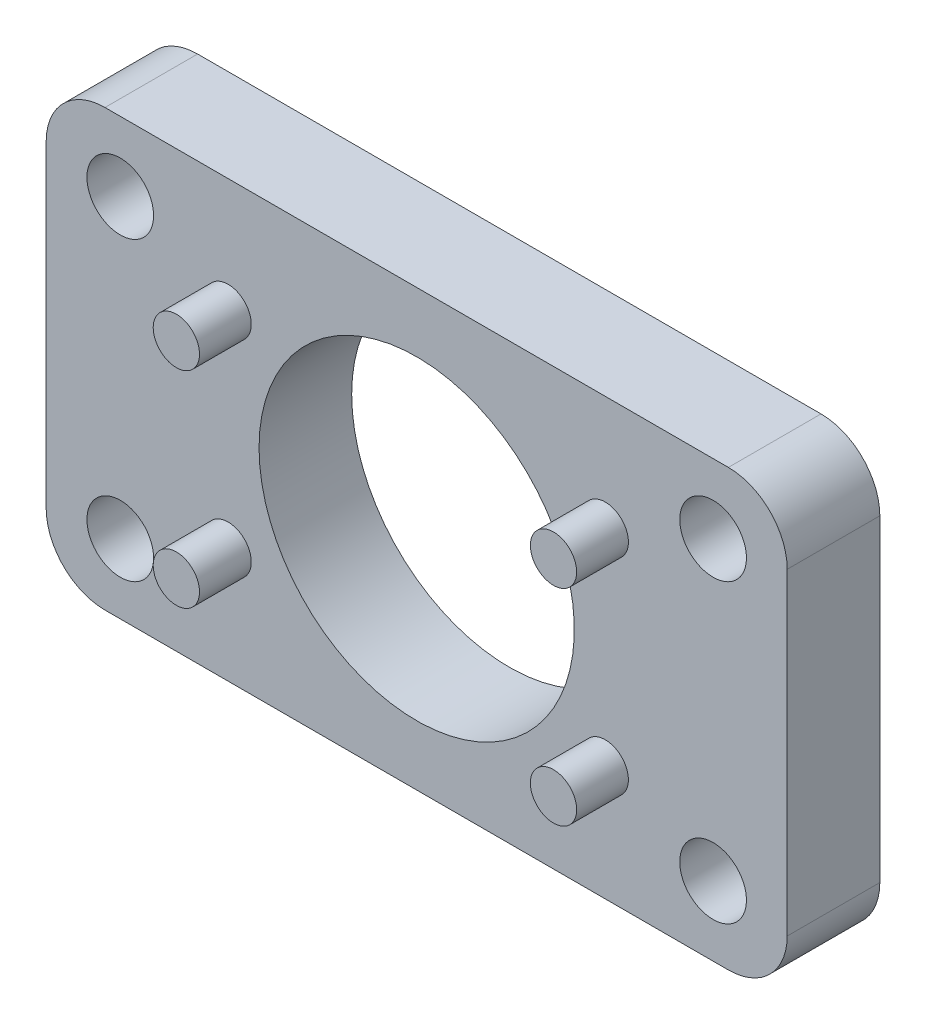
ISO-10303-21;
HEADER;
FILE_DESCRIPTION(('STEP AP214'),'2;1');
FILE_NAME('part.step','',(''),(''),'','','');
FILE_SCHEMA(('AUTOMOTIVE_DESIGN { 1 0 10303 214 1 1 1 1 }'));
ENDSEC;
DATA;
#1=APPLICATION_CONTEXT('core data for automotive mechanical design processes');
#2=APPLICATION_PROTOCOL_DEFINITION('international standard','automotive_design',2000,#1);
#3=PRODUCT_CONTEXT('',#1,'mechanical');
#4=PRODUCT('Part','Part','',(#3));
#5=PRODUCT_RELATED_PRODUCT_CATEGORY('part','',(#4));
#6=PRODUCT_DEFINITION_FORMATION('','',#4);
#7=PRODUCT_DEFINITION_CONTEXT('part definition',#1,'design');
#8=PRODUCT_DEFINITION('design','',#6,#7);
#9=PRODUCT_DEFINITION_SHAPE('','',#8);
#10=(LENGTH_UNIT() NAMED_UNIT(*) SI_UNIT(.MILLI.,.METRE.));
#11=(NAMED_UNIT(*) PLANE_ANGLE_UNIT() SI_UNIT($,.RADIAN.));
#12=(NAMED_UNIT(*) SI_UNIT($,.STERADIAN.) SOLID_ANGLE_UNIT());
#13=UNCERTAINTY_MEASURE_WITH_UNIT(LENGTH_MEASURE(1.E-05),#10,'distance_accuracy_value','');
#14=(GEOMETRIC_REPRESENTATION_CONTEXT(3) GLOBAL_UNCERTAINTY_ASSIGNED_CONTEXT((#13)) GLOBAL_UNIT_ASSIGNED_CONTEXT((#10,
#11,#12)) REPRESENTATION_CONTEXT('',''));
#15=CARTESIAN_POINT('',(0.,0.,0.));
#16=DIRECTION('',(0.,0.,1.));
#17=DIRECTION('',(1.,0.,0.));
#18=AXIS2_PLACEMENT_3D('',#15,#16,#17);
#19=CARTESIAN_POINT('',(-22.4056000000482,-14.6588740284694,-6.912));
#20=DIRECTION('',(0.,0.,1.));
#21=DIRECTION('',(0.,-1.,0.));
#22=AXIS2_PLACEMENT_3D('',#19,#20,#21);
#23=PLANE('',#22);
#24=DIRECTION('',(1.02070574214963E-11,1.,0.));
#25=VECTOR('',#24,1.);
#26=CARTESIAN_POINT('',(-22.4056000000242,-12.2946246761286,-6.912));
#27=LINE('',#26,#25);
#28=CARTESIAN_POINT('',(-22.4056000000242,-12.2946246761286,-6.912));
#29=VERTEX_POINT('',#28);
#30=CARTESIAN_POINT('',(-22.4056,-9.9303753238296,-6.912));
#31=VERTEX_POINT('',#30);
#32=EDGE_CURVE('E1191',#29,#31,#27,.T.);
#33=ORIENTED_EDGE('',*,*,#32,.T.);
#34=DIRECTION('',(0.86602540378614,0.499999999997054,0.));
#35=VECTOR('',#34,1.);
#36=CARTESIAN_POINT('',(-22.4056,-9.9303753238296,-6.912));
#37=LINE('',#36,#35);
#38=CARTESIAN_POINT('',(-20.3580999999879,-8.74825064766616,-6.912));
#39=VERTEX_POINT('',#38);
#40=EDGE_CURVE('E1194',#31,#39,#37,.T.);
#41=ORIENTED_EDGE('',*,*,#40,.T.);
#42=DIRECTION('',(0.866025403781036,-0.500000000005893,0.));
#43=VECTOR('',#42,1.);
#44=CARTESIAN_POINT('',(-20.3580999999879,-8.74825064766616,-6.912));
#45=LINE('',#44,#43);
#46=CARTESIAN_POINT('',(-18.310599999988,-9.9303753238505,-6.912));
#47=VERTEX_POINT('',#46);
#48=EDGE_CURVE('E1197',#39,#47,#45,.T.);
#49=ORIENTED_EDGE('',*,*,#48,.T.);
#50=DIRECTION('',(-1.02070574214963E-11,-1.,0.));
#51=VECTOR('',#50,1.);
#52=CARTESIAN_POINT('',(-18.310599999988,-9.9303753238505,-6.912));
#53=LINE('',#52,#51);
#54=CARTESIAN_POINT('',(-18.310600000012,-12.2946246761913,-6.912));
#55=VERTEX_POINT('',#54);
#56=EDGE_CURVE('E1200',#47,#55,#53,.T.);
#57=ORIENTED_EDGE('',*,*,#56,.T.);
#58=DIRECTION('',(-0.866025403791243,-0.499999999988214,0.));
#59=VECTOR('',#58,1.);
#60=CARTESIAN_POINT('',(-18.310600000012,-12.2946246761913,-6.912));
#61=LINE('',#60,#59);
#62=CARTESIAN_POINT('',(-20.3581000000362,-13.4767493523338,-6.912));
#63=VERTEX_POINT('',#62);
#64=EDGE_CURVE('E1203',#55,#63,#61,.T.);
#65=ORIENTED_EDGE('',*,*,#64,.T.);
#66=DIRECTION('',(-0.866025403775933,0.500000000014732,0.));
#67=VECTOR('',#66,1.);
#68=CARTESIAN_POINT('',(-20.3581000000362,-13.4767493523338,-6.912));
#69=LINE('',#68,#67);
#70=EDGE_CURVE('E1206',#63,#29,#69,.T.);
#71=ORIENTED_EDGE('',*,*,#70,.T.);
#72=EDGE_LOOP('',(#33,#41,#49,#57,#65,#71));
#73=FACE_BOUND('',#72,.T.);
#74=ADVANCED_FACE('F16',(#73),#23,.F.);
#75=CARTESIAN_POINT('',(-22.4056000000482,7.56612597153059,-6.912));
#76=DIRECTION('',(0.,0.,1.));
#77=DIRECTION('',(0.,-1.,0.));
#78=AXIS2_PLACEMENT_3D('',#75,#76,#77);
#79=PLANE('',#78);
#80=DIRECTION('',(1.02070574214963E-11,1.,0.));
#81=VECTOR('',#80,1.);
#82=CARTESIAN_POINT('',(-22.4056000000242,9.9303753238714,-6.912));
#83=LINE('',#82,#81);
#84=CARTESIAN_POINT('',(-22.4056000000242,9.9303753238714,-6.912));
#85=VERTEX_POINT('',#84);
#86=CARTESIAN_POINT('',(-22.4056,12.2946246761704,-6.912));
#87=VERTEX_POINT('',#86);
#88=EDGE_CURVE('E1255',#85,#87,#83,.T.);
#89=ORIENTED_EDGE('',*,*,#88,.T.);
#90=DIRECTION('',(0.86602540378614,0.499999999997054,0.));
#91=VECTOR('',#90,1.);
#92=CARTESIAN_POINT('',(-22.4056,12.2946246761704,-6.912));
#93=LINE('',#92,#91);
#94=CARTESIAN_POINT('',(-20.3580999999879,13.4767493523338,-6.912));
#95=VERTEX_POINT('',#94);
#96=EDGE_CURVE('E1258',#87,#95,#93,.T.);
#97=ORIENTED_EDGE('',*,*,#96,.T.);
#98=DIRECTION('',(0.866025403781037,-0.500000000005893,0.));
#99=VECTOR('',#98,1.);
#100=CARTESIAN_POINT('',(-20.3580999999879,13.4767493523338,-6.912));
#101=LINE('',#100,#99);
#102=CARTESIAN_POINT('',(-18.310599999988,12.2946246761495,-6.912));
#103=VERTEX_POINT('',#102);
#104=EDGE_CURVE('E1261',#95,#103,#101,.T.);
#105=ORIENTED_EDGE('',*,*,#104,.T.);
#106=DIRECTION('',(-1.02070574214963E-11,-1.,0.));
#107=VECTOR('',#106,1.);
#108=CARTESIAN_POINT('',(-18.310599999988,12.2946246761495,-6.912));
#109=LINE('',#108,#107);
#110=CARTESIAN_POINT('',(-18.310600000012,9.9303753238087,-6.912));
#111=VERTEX_POINT('',#110);
#112=EDGE_CURVE('E1264',#103,#111,#109,.T.);
#113=ORIENTED_EDGE('',*,*,#112,.T.);
#114=DIRECTION('',(-0.866025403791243,-0.499999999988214,0.));
#115=VECTOR('',#114,1.);
#116=CARTESIAN_POINT('',(-18.310600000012,9.9303753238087,-6.912));
#117=LINE('',#116,#115);
#118=CARTESIAN_POINT('',(-20.3581000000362,8.74825064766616,-6.912));
#119=VERTEX_POINT('',#118);
#120=EDGE_CURVE('E1267',#111,#119,#117,.T.);
#121=ORIENTED_EDGE('',*,*,#120,.T.);
#122=DIRECTION('',(-0.866025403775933,0.500000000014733,0.));
#123=VECTOR('',#122,1.);
#124=CARTESIAN_POINT('',(-20.3581000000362,8.74825064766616,-6.912));
#125=LINE('',#124,#123);
#126=EDGE_CURVE('E1270',#119,#85,#125,.T.);
#127=ORIENTED_EDGE('',*,*,#126,.T.);
#128=EDGE_LOOP('',(#89,#97,#105,#113,#121,#127));
#129=FACE_BOUND('',#128,.T.);
#130=ADVANCED_FACE('F448',(#129),#79,.F.);
#131=CARTESIAN_POINT('',(18.3105999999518,-14.6588740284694,-6.912));
#132=DIRECTION('',(0.,0.,1.));
#133=DIRECTION('',(0.,-1.,0.));
#134=AXIS2_PLACEMENT_3D('',#131,#132,#133);
#135=PLANE('',#134);
#136=DIRECTION('',(1.02070574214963E-11,1.,0.));
#137=VECTOR('',#136,1.);
#138=CARTESIAN_POINT('',(18.3105999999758,-12.2946246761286,-6.912));
#139=LINE('',#138,#137);
#140=CARTESIAN_POINT('',(18.3105999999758,-12.2946246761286,-6.912));
#141=VERTEX_POINT('',#140);
#142=CARTESIAN_POINT('',(18.3106,-9.93037532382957,-6.912));
#143=VERTEX_POINT('',#142);
#144=EDGE_CURVE('E240',#141,#143,#139,.T.);
#145=ORIENTED_EDGE('',*,*,#144,.T.);
#146=DIRECTION('',(0.86602540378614,0.499999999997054,0.));
#147=VECTOR('',#146,1.);
#148=CARTESIAN_POINT('',(18.3106,-9.93037532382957,-6.912));
#149=LINE('',#148,#147);
#150=CARTESIAN_POINT('',(20.3581000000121,-8.74825064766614,-6.912));
#151=VERTEX_POINT('',#150);
#152=EDGE_CURVE('E218',#143,#151,#149,.T.);
#153=ORIENTED_EDGE('',*,*,#152,.T.);
#154=DIRECTION('',(0.866025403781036,-0.500000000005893,0.));
#155=VECTOR('',#154,1.);
#156=CARTESIAN_POINT('',(20.3581000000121,-8.74825064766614,-6.912));
#157=LINE('',#156,#155);
#158=CARTESIAN_POINT('',(22.405600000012,-9.93037532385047,-6.912));
#159=VERTEX_POINT('',#158);
#160=EDGE_CURVE('E243',#151,#159,#157,.T.);
#161=ORIENTED_EDGE('',*,*,#160,.T.);
#162=DIRECTION('',(-1.02070574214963E-11,-1.,0.));
#163=VECTOR('',#162,1.);
#164=CARTESIAN_POINT('',(22.405600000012,-9.93037532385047,-6.912));
#165=LINE('',#164,#163);
#166=CARTESIAN_POINT('',(22.4055999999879,-12.2946246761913,-6.912));
#167=VERTEX_POINT('',#166);
#168=EDGE_CURVE('E246',#159,#167,#165,.T.);
#169=ORIENTED_EDGE('',*,*,#168,.T.);
#170=DIRECTION('',(-0.866025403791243,-0.499999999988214,0.));
#171=VECTOR('',#170,1.);
#172=CARTESIAN_POINT('',(22.4055999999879,-12.2946246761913,-6.912));
#173=LINE('',#172,#171);
#174=CARTESIAN_POINT('',(20.3580999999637,-13.4767493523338,-6.912));
#175=VERTEX_POINT('',#174);
#176=EDGE_CURVE('E249',#167,#175,#173,.T.);
#177=ORIENTED_EDGE('',*,*,#176,.T.);
#178=DIRECTION('',(-0.866025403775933,0.500000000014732,0.));
#179=VECTOR('',#178,1.);
#180=CARTESIAN_POINT('',(20.3580999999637,-13.4767493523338,-6.912));
#181=LINE('',#180,#179);
#182=EDGE_CURVE('E221',#175,#141,#181,.T.);
#183=ORIENTED_EDGE('',*,*,#182,.T.);
#184=EDGE_LOOP('',(#145,#153,#161,#169,#177,#183));
#185=FACE_BOUND('',#184,.T.);
#186=ADVANCED_FACE('F470',(#185),#135,.F.);
#187=CARTESIAN_POINT('',(-22.4056,-9.9303753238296,-6.912));
#188=DIRECTION('',(-0.499999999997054,0.86602540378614,0.));
#189=DIRECTION('',(0.86602540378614,0.499999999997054,0.));
#190=AXIS2_PLACEMENT_3D('',#187,#188,#189);
#191=PLANE('',#190);
#192=DIRECTION('',(0.86602540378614,0.499999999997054,0.));
#193=VECTOR('',#192,1.);
#194=CARTESIAN_POINT('',(-22.4056,-9.9303753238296,-9.412));
#195=LINE('',#194,#193);
#196=CARTESIAN_POINT('',(-22.4056,-9.9303753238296,-9.412));
#197=VERTEX_POINT('',#196);
#198=CARTESIAN_POINT('',(-20.3580999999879,-8.74825064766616,-9.412));
#199=VERTEX_POINT('',#198);
#200=EDGE_CURVE('E1176',#197,#199,#195,.T.);
#201=ORIENTED_EDGE('',*,*,#200,.T.);
#202=DIRECTION('',(0.,0.,-1.));
#203=VECTOR('',#202,1.);
#204=CARTESIAN_POINT('',(-20.3580999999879,-8.74825064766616,-6.912));
#205=LINE('',#204,#203);
#206=EDGE_CURVE('E1219',#39,#199,#205,.T.);
#207=ORIENTED_EDGE('',*,*,#206,.F.);
#208=ORIENTED_EDGE('',*,*,#40,.F.);
#209=DIRECTION('',(0.,0.,-1.));
#210=VECTOR('',#209,1.);
#211=CARTESIAN_POINT('',(-22.4056,-9.9303753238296,-6.912));
#212=LINE('',#211,#210);
#213=EDGE_CURVE('E1209',#31,#197,#212,.T.);
#214=ORIENTED_EDGE('',*,*,#213,.T.);
#215=EDGE_LOOP('',(#201,#207,#208,#214));
#216=FACE_BOUND('',#215,.T.);
#217=ADVANCED_FACE('F450',(#216),#191,.F.);
#218=CARTESIAN_POINT('',(-20.3580999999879,-8.74825064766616,-6.912));
#219=DIRECTION('',(0.500000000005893,0.866025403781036,0.));
#220=DIRECTION('',(0.866025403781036,-0.500000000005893,0.));
#221=AXIS2_PLACEMENT_3D('',#218,#219,#220);
#222=PLANE('',#221);
#223=DIRECTION('',(0.866025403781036,-0.500000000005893,0.));
#224=VECTOR('',#223,1.);
#225=CARTESIAN_POINT('',(-20.3580999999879,-8.74825064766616,-9.412));
#226=LINE('',#225,#224);
#227=CARTESIAN_POINT('',(-18.310599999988,-9.9303753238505,-9.412));
#228=VERTEX_POINT('',#227);
#229=EDGE_CURVE('E1179',#199,#228,#226,.T.);
#230=ORIENTED_EDGE('',*,*,#229,.T.);
#231=DIRECTION('',(0.,0.,-1.));
#232=VECTOR('',#231,1.);
#233=CARTESIAN_POINT('',(-18.310599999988,-9.9303753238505,-6.912));
#234=LINE('',#233,#232);
#235=EDGE_CURVE('E1217',#47,#228,#234,.T.);
#236=ORIENTED_EDGE('',*,*,#235,.F.);
#237=ORIENTED_EDGE('',*,*,#48,.F.);
#238=ORIENTED_EDGE('',*,*,#206,.T.);
#239=EDGE_LOOP('',(#230,#236,#237,#238));
#240=FACE_BOUND('',#239,.T.);
#241=ADVANCED_FACE('F463',(#240),#222,.F.);
#242=CARTESIAN_POINT('',(-18.310599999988,-9.9303753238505,-6.912));
#243=DIRECTION('',(1.,-1.02070574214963E-11,0.));
#244=DIRECTION('',(-1.02070574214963E-11,-1.,0.));
#245=AXIS2_PLACEMENT_3D('',#242,#243,#244);
#246=PLANE('',#245);
#247=DIRECTION('',(-1.02070574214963E-11,-1.,0.));
#248=VECTOR('',#247,1.);
#249=CARTESIAN_POINT('',(-18.310599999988,-9.9303753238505,-9.412));
#250=LINE('',#249,#248);
#251=CARTESIAN_POINT('',(-18.310600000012,-12.2946246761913,-9.412));
#252=VERTEX_POINT('',#251);
#253=EDGE_CURVE('E1182',#228,#252,#250,.T.);
#254=ORIENTED_EDGE('',*,*,#253,.T.);
#255=DIRECTION('',(0.,0.,-1.));
#256=VECTOR('',#255,1.);
#257=CARTESIAN_POINT('',(-18.310600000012,-12.2946246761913,-6.912));
#258=LINE('',#257,#256);
#259=EDGE_CURVE('E1215',#55,#252,#258,.T.);
#260=ORIENTED_EDGE('',*,*,#259,.F.);
#261=ORIENTED_EDGE('',*,*,#56,.F.);
#262=ORIENTED_EDGE('',*,*,#235,.T.);
#263=EDGE_LOOP('',(#254,#260,#261,#262));
#264=FACE_BOUND('',#263,.T.);
#265=ADVANCED_FACE('F459',(#264),#246,.F.);
#266=CARTESIAN_POINT('',(-18.310600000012,-12.2946246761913,-6.912));
#267=DIRECTION('',(0.499999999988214,-0.866025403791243,0.));
#268=DIRECTION('',(-0.866025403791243,-0.499999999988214,0.));
#269=AXIS2_PLACEMENT_3D('',#266,#267,#268);
#270=PLANE('',#269);
#271=DIRECTION('',(-0.866025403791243,-0.499999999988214,0.));
#272=VECTOR('',#271,1.);
#273=CARTESIAN_POINT('',(-18.310600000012,-12.2946246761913,-9.412));
#274=LINE('',#273,#272);
#275=CARTESIAN_POINT('',(-20.3581000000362,-13.4767493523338,-9.412));
#276=VERTEX_POINT('',#275);
#277=EDGE_CURVE('E1185',#252,#276,#274,.T.);
#278=ORIENTED_EDGE('',*,*,#277,.T.);
#279=DIRECTION('',(0.,0.,-1.));
#280=VECTOR('',#279,1.);
#281=CARTESIAN_POINT('',(-20.3581000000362,-13.4767493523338,-6.912));
#282=LINE('',#281,#280);
#283=EDGE_CURVE('E1213',#63,#276,#282,.T.);
#284=ORIENTED_EDGE('',*,*,#283,.F.);
#285=ORIENTED_EDGE('',*,*,#64,.F.);
#286=ORIENTED_EDGE('',*,*,#259,.T.);
#287=EDGE_LOOP('',(#278,#284,#285,#286));
#288=FACE_BOUND('',#287,.T.);
#289=ADVANCED_FACE('F455',(#288),#270,.F.);
#290=CARTESIAN_POINT('',(-20.3581000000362,-13.4767493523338,-6.912));
#291=DIRECTION('',(-0.500000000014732,-0.866025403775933,0.));
#292=DIRECTION('',(-0.866025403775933,0.500000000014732,0.));
#293=AXIS2_PLACEMENT_3D('',#290,#291,#292);
#294=PLANE('',#293);
#295=DIRECTION('',(-0.866025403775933,0.500000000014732,0.));
#296=VECTOR('',#295,1.);
#297=CARTESIAN_POINT('',(-20.3581000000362,-13.4767493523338,-9.412));
#298=LINE('',#297,#296);
#299=CARTESIAN_POINT('',(-22.4056000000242,-12.2946246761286,-9.412));
#300=VERTEX_POINT('',#299);
#301=EDGE_CURVE('E1188',#276,#300,#298,.T.);
#302=ORIENTED_EDGE('',*,*,#301,.T.);
#303=DIRECTION('',(0.,0.,-1.));
#304=VECTOR('',#303,1.);
#305=CARTESIAN_POINT('',(-22.4056000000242,-12.2946246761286,-6.912));
#306=LINE('',#305,#304);
#307=EDGE_CURVE('E1210',#29,#300,#306,.T.);
#308=ORIENTED_EDGE('',*,*,#307,.F.);
#309=ORIENTED_EDGE('',*,*,#70,.F.);
#310=ORIENTED_EDGE('',*,*,#283,.T.);
#311=EDGE_LOOP('',(#302,#308,#309,#310));
#312=FACE_BOUND('',#311,.T.);
#313=ADVANCED_FACE('F451',(#312),#294,.F.);
#314=CARTESIAN_POINT('',(-22.4056000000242,-12.2946246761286,-6.912));
#315=DIRECTION('',(-1.,1.02070574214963E-11,0.));
#316=DIRECTION('',(1.02070574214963E-11,1.,0.));
#317=AXIS2_PLACEMENT_3D('',#314,#315,#316);
#318=PLANE('',#317);
#319=DIRECTION('',(1.02070574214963E-11,1.,0.));
#320=VECTOR('',#319,1.);
#321=CARTESIAN_POINT('',(-22.4056000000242,-12.2946246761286,-9.412));
#322=LINE('',#321,#320);
#323=EDGE_CURVE('E1173',#300,#197,#322,.T.);
#324=ORIENTED_EDGE('',*,*,#323,.T.);
#325=ORIENTED_EDGE('',*,*,#213,.F.);
#326=ORIENTED_EDGE('',*,*,#32,.F.);
#327=ORIENTED_EDGE('',*,*,#307,.T.);
#328=EDGE_LOOP('',(#324,#325,#326,#327));
#329=FACE_BOUND('',#328,.T.);
#330=ADVANCED_FACE('F454',(#329),#318,.F.);
#331=CARTESIAN_POINT('',(-22.4056,12.2946246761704,-6.912));
#332=DIRECTION('',(-0.499999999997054,0.86602540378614,0.));
#333=DIRECTION('',(0.86602540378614,0.499999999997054,0.));
#334=AXIS2_PLACEMENT_3D('',#331,#332,#333);
#335=PLANE('',#334);
#336=DIRECTION('',(0.86602540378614,0.499999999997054,0.));
#337=VECTOR('',#336,1.);
#338=CARTESIAN_POINT('',(-22.4056,12.2946246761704,-9.412));
#339=LINE('',#338,#337);
#340=CARTESIAN_POINT('',(-22.4056,12.2946246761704,-9.412));
#341=VERTEX_POINT('',#340);
#342=CARTESIAN_POINT('',(-20.3580999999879,13.4767493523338,-9.412));
#343=VERTEX_POINT('',#342);
#344=EDGE_CURVE('E1240',#341,#343,#339,.T.);
#345=ORIENTED_EDGE('',*,*,#344,.T.);
#346=DIRECTION('',(0.,0.,-1.));
#347=VECTOR('',#346,1.);
#348=CARTESIAN_POINT('',(-20.3580999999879,13.4767493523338,-6.912));
#349=LINE('',#348,#347);
#350=EDGE_CURVE('E1283',#95,#343,#349,.T.);
#351=ORIENTED_EDGE('',*,*,#350,.F.);
#352=ORIENTED_EDGE('',*,*,#96,.F.);
#353=DIRECTION('',(0.,0.,-1.));
#354=VECTOR('',#353,1.);
#355=CARTESIAN_POINT('',(-22.4056,12.2946246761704,-6.912));
#356=LINE('',#355,#354);
#357=EDGE_CURVE('E1273',#87,#341,#356,.T.);
#358=ORIENTED_EDGE('',*,*,#357,.T.);
#359=EDGE_LOOP('',(#345,#351,#352,#358));
#360=FACE_BOUND('',#359,.T.);
#361=ADVANCED_FACE('F474',(#360),#335,.F.);
#362=CARTESIAN_POINT('',(-20.3580999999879,13.4767493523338,-6.912));
#363=DIRECTION('',(0.500000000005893,0.866025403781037,0.));
#364=DIRECTION('',(0.866025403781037,-0.500000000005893,0.));
#365=AXIS2_PLACEMENT_3D('',#362,#363,#364);
#366=PLANE('',#365);
#367=DIRECTION('',(0.866025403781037,-0.500000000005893,0.));
#368=VECTOR('',#367,1.);
#369=CARTESIAN_POINT('',(-20.3580999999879,13.4767493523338,-9.412));
#370=LINE('',#369,#368);
#371=CARTESIAN_POINT('',(-18.310599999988,12.2946246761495,-9.412));
#372=VERTEX_POINT('',#371);
#373=EDGE_CURVE('E1243',#343,#372,#370,.T.);
#374=ORIENTED_EDGE('',*,*,#373,.T.);
#375=DIRECTION('',(0.,0.,-1.));
#376=VECTOR('',#375,1.);
#377=CARTESIAN_POINT('',(-18.310599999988,12.2946246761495,-6.912));
#378=LINE('',#377,#376);
#379=EDGE_CURVE('E1281',#103,#372,#378,.T.);
#380=ORIENTED_EDGE('',*,*,#379,.F.);
#381=ORIENTED_EDGE('',*,*,#104,.F.);
#382=ORIENTED_EDGE('',*,*,#350,.T.);
#383=EDGE_LOOP('',(#374,#380,#381,#382));
#384=FACE_BOUND('',#383,.T.);
#385=ADVANCED_FACE('F513',(#384),#366,.F.);
#386=CARTESIAN_POINT('',(-18.310599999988,12.2946246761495,-6.912));
#387=DIRECTION('',(1.,-1.02070574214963E-11,0.));
#388=DIRECTION('',(-1.02070574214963E-11,-1.,0.));
#389=AXIS2_PLACEMENT_3D('',#386,#387,#388);
#390=PLANE('',#389);
#391=DIRECTION('',(-1.02070574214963E-11,-1.,0.));
#392=VECTOR('',#391,1.);
#393=CARTESIAN_POINT('',(-18.310599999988,12.2946246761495,-9.412));
#394=LINE('',#393,#392);
#395=CARTESIAN_POINT('',(-18.310600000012,9.9303753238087,-9.412));
#396=VERTEX_POINT('',#395);
#397=EDGE_CURVE('E1246',#372,#396,#394,.T.);
#398=ORIENTED_EDGE('',*,*,#397,.T.);
#399=DIRECTION('',(0.,0.,-1.));
#400=VECTOR('',#399,1.);
#401=CARTESIAN_POINT('',(-18.310600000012,9.9303753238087,-6.912));
#402=LINE('',#401,#400);
#403=EDGE_CURVE('E1279',#111,#396,#402,.T.);
#404=ORIENTED_EDGE('',*,*,#403,.F.);
#405=ORIENTED_EDGE('',*,*,#112,.F.);
#406=ORIENTED_EDGE('',*,*,#379,.T.);
#407=EDGE_LOOP('',(#398,#404,#405,#406));
#408=FACE_BOUND('',#407,.T.);
#409=ADVANCED_FACE('F509',(#408),#390,.F.);
#410=CARTESIAN_POINT('',(-18.310600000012,9.9303753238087,-6.912));
#411=DIRECTION('',(0.499999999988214,-0.866025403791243,0.));
#412=DIRECTION('',(-0.866025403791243,-0.499999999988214,0.));
#413=AXIS2_PLACEMENT_3D('',#410,#411,#412);
#414=PLANE('',#413);
#415=DIRECTION('',(-0.866025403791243,-0.499999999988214,0.));
#416=VECTOR('',#415,1.);
#417=CARTESIAN_POINT('',(-18.310600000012,9.9303753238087,-9.412));
#418=LINE('',#417,#416);
#419=CARTESIAN_POINT('',(-20.3581000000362,8.74825064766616,-9.412));
#420=VERTEX_POINT('',#419);
#421=EDGE_CURVE('E1249',#396,#420,#418,.T.);
#422=ORIENTED_EDGE('',*,*,#421,.T.);
#423=DIRECTION('',(0.,0.,-1.));
#424=VECTOR('',#423,1.);
#425=CARTESIAN_POINT('',(-20.3581000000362,8.74825064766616,-6.912));
#426=LINE('',#425,#424);
#427=EDGE_CURVE('E1277',#119,#420,#426,.T.);
#428=ORIENTED_EDGE('',*,*,#427,.F.);
#429=ORIENTED_EDGE('',*,*,#120,.F.);
#430=ORIENTED_EDGE('',*,*,#403,.T.);
#431=EDGE_LOOP('',(#422,#428,#429,#430));
#432=FACE_BOUND('',#431,.T.);
#433=ADVANCED_FACE('F505',(#432),#414,.F.);
#434=CARTESIAN_POINT('',(-20.3581000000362,8.74825064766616,-6.912));
#435=DIRECTION('',(-0.500000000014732,-0.866025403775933,0.));
#436=DIRECTION('',(-0.866025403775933,0.500000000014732,0.));
#437=AXIS2_PLACEMENT_3D('',#434,#435,#436);
#438=PLANE('',#437);
#439=DIRECTION('',(-0.866025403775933,0.500000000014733,0.));
#440=VECTOR('',#439,1.);
#441=CARTESIAN_POINT('',(-20.3581000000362,8.74825064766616,-9.412));
#442=LINE('',#441,#440);
#443=CARTESIAN_POINT('',(-22.4056000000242,9.9303753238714,-9.412));
#444=VERTEX_POINT('',#443);
#445=EDGE_CURVE('E1252',#420,#444,#442,.T.);
#446=ORIENTED_EDGE('',*,*,#445,.T.);
#447=DIRECTION('',(0.,0.,-1.));
#448=VECTOR('',#447,1.);
#449=CARTESIAN_POINT('',(-22.4056000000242,9.9303753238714,-6.912));
#450=LINE('',#449,#448);
#451=EDGE_CURVE('E1274',#85,#444,#450,.T.);
#452=ORIENTED_EDGE('',*,*,#451,.F.);
#453=ORIENTED_EDGE('',*,*,#126,.F.);
#454=ORIENTED_EDGE('',*,*,#427,.T.);
#455=EDGE_LOOP('',(#446,#452,#453,#454));
#456=FACE_BOUND('',#455,.T.);
#457=ADVANCED_FACE('F501',(#456),#438,.F.);
#458=CARTESIAN_POINT('',(-22.4056000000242,9.9303753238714,-6.912));
#459=DIRECTION('',(-1.,1.02070574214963E-11,0.));
#460=DIRECTION('',(1.02070574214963E-11,1.,0.));
#461=AXIS2_PLACEMENT_3D('',#458,#459,#460);
#462=PLANE('',#461);
#463=DIRECTION('',(1.02070574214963E-11,1.,0.));
#464=VECTOR('',#463,1.);
#465=CARTESIAN_POINT('',(-22.4056000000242,9.9303753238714,-9.412));
#466=LINE('',#465,#464);
#467=EDGE_CURVE('E1238',#444,#341,#466,.T.);
#468=ORIENTED_EDGE('',*,*,#467,.T.);
#469=ORIENTED_EDGE('',*,*,#357,.F.);
#470=ORIENTED_EDGE('',*,*,#88,.F.);
#471=ORIENTED_EDGE('',*,*,#451,.T.);
#472=EDGE_LOOP('',(#468,#469,#470,#471));
#473=FACE_BOUND('',#472,.T.);
#474=ADVANCED_FACE('F504',(#473),#462,.F.);
#475=CARTESIAN_POINT('',(18.3106,-9.93037532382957,-6.912));
#476=DIRECTION('',(-0.499999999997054,0.86602540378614,0.));
#477=DIRECTION('',(0.86602540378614,0.499999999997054,0.));
#478=AXIS2_PLACEMENT_3D('',#475,#476,#477);
#479=PLANE('',#478);
#480=DIRECTION('',(0.86602540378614,0.499999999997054,0.));
#481=VECTOR('',#480,1.);
#482=CARTESIAN_POINT('',(18.3106,-9.93037532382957,-9.412));
#483=LINE('',#482,#481);
#484=CARTESIAN_POINT('',(18.3106,-9.93037532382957,-9.412));
#485=VERTEX_POINT('',#484);
#486=CARTESIAN_POINT('',(20.3581000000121,-8.74825064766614,-9.412));
#487=VERTEX_POINT('',#486);
#488=EDGE_CURVE('E210',#485,#487,#483,.T.);
#489=ORIENTED_EDGE('',*,*,#488,.T.);
#490=DIRECTION('',(0.,0.,-1.));
#491=VECTOR('',#490,1.);
#492=CARTESIAN_POINT('',(20.3581000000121,-8.74825064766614,-6.912));
#493=LINE('',#492,#491);
#494=EDGE_CURVE('E220',#151,#487,#493,.T.);
#495=ORIENTED_EDGE('',*,*,#494,.F.);
#496=ORIENTED_EDGE('',*,*,#152,.F.);
#497=DIRECTION('',(0.,0.,-1.));
#498=VECTOR('',#497,1.);
#499=CARTESIAN_POINT('',(18.3106,-9.93037532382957,-6.912));
#500=LINE('',#499,#498);
#501=EDGE_CURVE('E205',#143,#485,#500,.T.);
#502=ORIENTED_EDGE('',*,*,#501,.T.);
#503=EDGE_LOOP('',(#489,#495,#496,#502));
#504=FACE_BOUND('',#503,.T.);
#505=ADVANCED_FACE('F215',(#504),#479,.F.);
#506=CARTESIAN_POINT('',(20.3581000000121,-8.74825064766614,-6.912));
#507=DIRECTION('',(0.500000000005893,0.866025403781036,0.));
#508=DIRECTION('',(0.866025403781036,-0.500000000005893,0.));
#509=AXIS2_PLACEMENT_3D('',#506,#507,#508);
#510=PLANE('',#509);
#511=DIRECTION('',(0.866025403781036,-0.500000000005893,0.));
#512=VECTOR('',#511,1.);
#513=CARTESIAN_POINT('',(20.3581000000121,-8.74825064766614,-9.412));
#514=LINE('',#513,#512);
#515=CARTESIAN_POINT('',(22.405600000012,-9.93037532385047,-9.412));
#516=VERTEX_POINT('',#515);
#517=EDGE_CURVE('E227',#487,#516,#514,.T.);
#518=ORIENTED_EDGE('',*,*,#517,.T.);
#519=DIRECTION('',(0.,0.,-1.));
#520=VECTOR('',#519,1.);
#521=CARTESIAN_POINT('',(22.405600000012,-9.93037532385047,-6.912));
#522=LINE('',#521,#520);
#523=EDGE_CURVE('E260',#159,#516,#522,.T.);
#524=ORIENTED_EDGE('',*,*,#523,.F.);
#525=ORIENTED_EDGE('',*,*,#160,.F.);
#526=ORIENTED_EDGE('',*,*,#494,.T.);
#527=EDGE_LOOP('',(#518,#524,#525,#526));
#528=FACE_BOUND('',#527,.T.);
#529=ADVANCED_FACE('F623',(#528),#510,.F.);
#530=CARTESIAN_POINT('',(22.405600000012,-9.93037532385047,-6.912));
#531=DIRECTION('',(1.,-1.02070574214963E-11,0.));
#532=DIRECTION('',(-1.02070574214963E-11,-1.,0.));
#533=AXIS2_PLACEMENT_3D('',#530,#531,#532);
#534=PLANE('',#533);
#535=DIRECTION('',(-1.02070574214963E-11,-1.,0.));
#536=VECTOR('',#535,1.);
#537=CARTESIAN_POINT('',(22.405600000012,-9.93037532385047,-9.412));
#538=LINE('',#537,#536);
#539=CARTESIAN_POINT('',(22.4055999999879,-12.2946246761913,-9.412));
#540=VERTEX_POINT('',#539);
#541=EDGE_CURVE('E229',#516,#540,#538,.T.);
#542=ORIENTED_EDGE('',*,*,#541,.T.);
#543=DIRECTION('',(0.,0.,-1.));
#544=VECTOR('',#543,1.);
#545=CARTESIAN_POINT('',(22.4055999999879,-12.2946246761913,-6.912));
#546=LINE('',#545,#544);
#547=EDGE_CURVE('E258',#167,#540,#546,.T.);
#548=ORIENTED_EDGE('',*,*,#547,.F.);
#549=ORIENTED_EDGE('',*,*,#168,.F.);
#550=ORIENTED_EDGE('',*,*,#523,.T.);
#551=EDGE_LOOP('',(#542,#548,#549,#550));
#552=FACE_BOUND('',#551,.T.);
#553=ADVANCED_FACE('F619',(#552),#534,.F.);
#554=CARTESIAN_POINT('',(22.4055999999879,-12.2946246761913,-6.912));
#555=DIRECTION('',(0.499999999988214,-0.866025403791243,0.));
#556=DIRECTION('',(-0.866025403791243,-0.499999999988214,0.));
#557=AXIS2_PLACEMENT_3D('',#554,#555,#556);
#558=PLANE('',#557);
#559=DIRECTION('',(-0.866025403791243,-0.499999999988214,0.));
#560=VECTOR('',#559,1.);
#561=CARTESIAN_POINT('',(22.4055999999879,-12.2946246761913,-9.412));
#562=LINE('',#561,#560);
#563=CARTESIAN_POINT('',(20.3580999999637,-13.4767493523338,-9.412));
#564=VERTEX_POINT('',#563);
#565=EDGE_CURVE('E235',#540,#564,#562,.T.);
#566=ORIENTED_EDGE('',*,*,#565,.T.);
#567=DIRECTION('',(0.,0.,-1.));
#568=VECTOR('',#567,1.);
#569=CARTESIAN_POINT('',(20.3580999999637,-13.4767493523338,-6.912));
#570=LINE('',#569,#568);
#571=EDGE_CURVE('E256',#175,#564,#570,.T.);
#572=ORIENTED_EDGE('',*,*,#571,.F.);
#573=ORIENTED_EDGE('',*,*,#176,.F.);
#574=ORIENTED_EDGE('',*,*,#547,.T.);
#575=EDGE_LOOP('',(#566,#572,#573,#574));
#576=FACE_BOUND('',#575,.T.);
#577=ADVANCED_FACE('F616',(#576),#558,.F.);
#578=CARTESIAN_POINT('',(20.3580999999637,-13.4767493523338,-6.912));
#579=DIRECTION('',(-0.500000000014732,-0.866025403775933,0.));
#580=DIRECTION('',(-0.866025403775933,0.500000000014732,0.));
#581=AXIS2_PLACEMENT_3D('',#578,#579,#580);
#582=PLANE('',#581);
#583=DIRECTION('',(-0.866025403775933,0.500000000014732,0.));
#584=VECTOR('',#583,1.);
#585=CARTESIAN_POINT('',(20.3580999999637,-13.4767493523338,-9.412));
#586=LINE('',#585,#584);
#587=CARTESIAN_POINT('',(18.3105999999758,-12.2946246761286,-9.412));
#588=VERTEX_POINT('',#587);
#589=EDGE_CURVE('E238',#564,#588,#586,.T.);
#590=ORIENTED_EDGE('',*,*,#589,.T.);
#591=DIRECTION('',(0.,0.,-1.));
#592=VECTOR('',#591,1.);
#593=CARTESIAN_POINT('',(18.3105999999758,-12.2946246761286,-6.912));
#594=LINE('',#593,#592);
#595=EDGE_CURVE('E197',#141,#588,#594,.T.);
#596=ORIENTED_EDGE('',*,*,#595,.F.);
#597=ORIENTED_EDGE('',*,*,#182,.F.);
#598=ORIENTED_EDGE('',*,*,#571,.T.);
#599=EDGE_LOOP('',(#590,#596,#597,#598));
#600=FACE_BOUND('',#599,.T.);
#601=ADVANCED_FACE('F613',(#600),#582,.F.);
#602=CARTESIAN_POINT('',(18.3105999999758,-12.2946246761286,-6.912));
#603=DIRECTION('',(-1.,1.02070574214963E-11,0.));
#604=DIRECTION('',(1.02070574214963E-11,1.,0.));
#605=AXIS2_PLACEMENT_3D('',#602,#603,#604);
#606=PLANE('',#605);
#607=DIRECTION('',(1.02070574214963E-11,1.,0.));
#608=VECTOR('',#607,1.);
#609=CARTESIAN_POINT('',(18.3105999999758,-12.2946246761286,-9.412));
#610=LINE('',#609,#608);
#611=EDGE_CURVE('E202',#588,#485,#610,.T.);
#612=ORIENTED_EDGE('',*,*,#611,.T.);
#613=ORIENTED_EDGE('',*,*,#501,.F.);
#614=ORIENTED_EDGE('',*,*,#144,.F.);
#615=ORIENTED_EDGE('',*,*,#595,.T.);
#616=EDGE_LOOP('',(#612,#613,#614,#615));
#617=FACE_BOUND('',#616,.T.);
#618=ADVANCED_FACE('F204',(#617),#606,.F.);
#619=CARTESIAN_POINT('',(-16.5331,-11.1125,-9.412));
#620=DIRECTION('',(0.,0.,-1.));
#621=DIRECTION('',(0.,1.,0.));
#622=AXIS2_PLACEMENT_3D('',#619,#620,#621);
#623=PLANE('',#622);
#624=ORIENTED_EDGE('',*,*,#323,.F.);
#625=ORIENTED_EDGE('',*,*,#301,.F.);
#626=ORIENTED_EDGE('',*,*,#277,.F.);
#627=ORIENTED_EDGE('',*,*,#253,.F.);
#628=ORIENTED_EDGE('',*,*,#229,.F.);
#629=ORIENTED_EDGE('',*,*,#200,.F.);
#630=EDGE_LOOP('',(#624,#625,#626,#627,#628,#629));
#631=FACE_BOUND('',#630,.T.);
#632=CARTESIAN_POINT('',(-20.3581,-11.1125,-9.412));
#633=DIRECTION('',(0.,0.,1.));
#634=DIRECTION('',(0.,-1.,0.));
#635=AXIS2_PLACEMENT_3D('',#632,#633,#634);
#636=CIRCLE('',#635,3.825);
#637=CARTESIAN_POINT('',(-20.3581,-14.9375,-9.412));
#638=VERTEX_POINT('',#637);
#639=EDGE_CURVE('E1212',#638,#638,#636,.T.);
#640=ORIENTED_EDGE('',*,*,#639,.F.);
#641=EDGE_LOOP('',(#640));
#642=FACE_BOUND('',#641,.T.);
#643=ADVANCED_FACE('F476',(#631,#642),#623,.T.);
#644=CARTESIAN_POINT('',(-16.5331,11.1125,-9.412));
#645=DIRECTION('',(0.,0.,-1.));
#646=DIRECTION('',(0.,1.,0.));
#647=AXIS2_PLACEMENT_3D('',#644,#645,#646);
#648=PLANE('',#647);
#649=ORIENTED_EDGE('',*,*,#467,.F.);
#650=ORIENTED_EDGE('',*,*,#445,.F.);
#651=ORIENTED_EDGE('',*,*,#421,.F.);
#652=ORIENTED_EDGE('',*,*,#397,.F.);
#653=ORIENTED_EDGE('',*,*,#373,.F.);
#654=ORIENTED_EDGE('',*,*,#344,.F.);
#655=EDGE_LOOP('',(#649,#650,#651,#652,#653,#654));
#656=FACE_BOUND('',#655,.T.);
#657=CARTESIAN_POINT('',(-20.3581,11.1125,-9.412));
#658=DIRECTION('',(0.,0.,1.));
#659=DIRECTION('',(0.,-1.,0.));
#660=AXIS2_PLACEMENT_3D('',#657,#658,#659);
#661=CIRCLE('',#660,3.825);
#662=CARTESIAN_POINT('',(-20.3581,7.2875,-9.412));
#663=VERTEX_POINT('',#662);
#664=EDGE_CURVE('E1276',#663,#663,#661,.T.);
#665=ORIENTED_EDGE('',*,*,#664,.F.);
#666=EDGE_LOOP('',(#665));
#667=FACE_BOUND('',#666,.T.);
#668=ADVANCED_FACE('F486',(#656,#667),#648,.T.);
#669=CARTESIAN_POINT('',(24.1831,-11.1125,-9.412));
#670=DIRECTION('',(0.,0.,-1.));
#671=DIRECTION('',(0.,1.,0.));
#672=AXIS2_PLACEMENT_3D('',#669,#670,#671);
#673=PLANE('',#672);
#674=ORIENTED_EDGE('',*,*,#611,.F.);
#675=ORIENTED_EDGE('',*,*,#589,.F.);
#676=ORIENTED_EDGE('',*,*,#565,.F.);
#677=ORIENTED_EDGE('',*,*,#541,.F.);
#678=ORIENTED_EDGE('',*,*,#517,.F.);
#679=ORIENTED_EDGE('',*,*,#488,.F.);
#680=EDGE_LOOP('',(#674,#675,#676,#677,#678,#679));
#681=FACE_BOUND('',#680,.T.);
#682=CARTESIAN_POINT('',(20.3581,-11.1125,-9.412));
#683=DIRECTION('',(0.,0.,1.));
#684=DIRECTION('',(0.,-1.,0.));
#685=AXIS2_PLACEMENT_3D('',#682,#683,#684);
#686=CIRCLE('',#685,3.825);
#687=CARTESIAN_POINT('',(20.3581,-14.9375,-9.412));
#688=VERTEX_POINT('',#687);
#689=EDGE_CURVE('E255',#688,#688,#686,.T.);
#690=ORIENTED_EDGE('',*,*,#689,.F.);
#691=EDGE_LOOP('',(#690));
#692=FACE_BOUND('',#691,.T.);
#693=ADVANCED_FACE('F223',(#681,#692),#673,.T.);
#694=CARTESIAN_POINT('',(-20.3581,-11.1125,-8.987));
#695=DIRECTION('',(0.,0.,1.));
#696=DIRECTION('',(0.,-1.,0.));
#697=AXIS2_PLACEMENT_3D('',#694,#695,#696);
#698=CONICAL_SURFACE('',#697,4.25,0.785398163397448);
#699=ORIENTED_EDGE('',*,*,#639,.T.);
#700=EDGE_LOOP('',(#699));
#701=FACE_BOUND('',#700,.T.);
#702=CARTESIAN_POINT('',(-20.3581,-11.1125,-8.987));
#703=DIRECTION('',(0.,0.,1.));
#704=DIRECTION('',(0.,-1.,0.));
#705=AXIS2_PLACEMENT_3D('',#702,#703,#704);
#706=CIRCLE('',#705,4.25);
#707=CARTESIAN_POINT('',(-20.3581,-15.3625,-8.987));
#708=VERTEX_POINT('',#707);
#709=EDGE_CURVE('E1225',#708,#708,#706,.T.);
#710=ORIENTED_EDGE('',*,*,#709,.F.);
#711=EDGE_LOOP('',(#710));
#712=FACE_BOUND('',#711,.T.);
#713=ADVANCED_FACE('F488',(#701,#712),#698,.T.);
#714=CARTESIAN_POINT('',(-20.3581,11.1125,-8.987));
#715=DIRECTION('',(0.,0.,1.));
#716=DIRECTION('',(0.,-1.,0.));
#717=AXIS2_PLACEMENT_3D('',#714,#715,#716);
#718=CONICAL_SURFACE('',#717,4.25,0.785398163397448);
#719=ORIENTED_EDGE('',*,*,#664,.T.);
#720=EDGE_LOOP('',(#719));
#721=FACE_BOUND('',#720,.T.);
#722=CARTESIAN_POINT('',(-20.3581,11.1125,-8.987));
#723=DIRECTION('',(0.,0.,1.));
#724=DIRECTION('',(0.,-1.,0.));
#725=AXIS2_PLACEMENT_3D('',#722,#723,#724);
#726=CIRCLE('',#725,4.25);
#727=CARTESIAN_POINT('',(-20.3581,6.8625,-8.987));
#728=VERTEX_POINT('',#727);
#729=EDGE_CURVE('E1289',#728,#728,#726,.T.);
#730=ORIENTED_EDGE('',*,*,#729,.F.);
#731=EDGE_LOOP('',(#730));
#732=FACE_BOUND('',#731,.T.);
#733=ADVANCED_FACE('F491',(#721,#732),#718,.T.);
#734=CARTESIAN_POINT('',(20.3581,-11.1125,-8.987));
#735=DIRECTION('',(0.,0.,1.));
#736=DIRECTION('',(0.,-1.,0.));
#737=AXIS2_PLACEMENT_3D('',#734,#735,#736);
#738=CONICAL_SURFACE('',#737,4.25,0.785398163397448);
#739=ORIENTED_EDGE('',*,*,#689,.T.);
#740=EDGE_LOOP('',(#739));
#741=FACE_BOUND('',#740,.T.);
#742=CARTESIAN_POINT('',(20.3581,-11.1125,-8.987));
#743=DIRECTION('',(0.,0.,1.));
#744=DIRECTION('',(0.,-1.,0.));
#745=AXIS2_PLACEMENT_3D('',#742,#743,#744);
#746=CIRCLE('',#745,4.25);
#747=CARTESIAN_POINT('',(20.3581,-15.3625,-8.987));
#748=VERTEX_POINT('',#747);
#749=EDGE_CURVE('E264',#748,#748,#746,.T.);
#750=ORIENTED_EDGE('',*,*,#749,.F.);
#751=EDGE_LOOP('',(#750));
#752=FACE_BOUND('',#751,.T.);
#753=ADVANCED_FACE('F496',(#741,#752),#738,.T.);
#754=CARTESIAN_POINT('',(-20.3581,-11.1125,-4.412));
#755=DIRECTION('',(0.,0.,1.));
#756=DIRECTION('',(0.,-1.,0.));
#757=AXIS2_PLACEMENT_3D('',#754,#755,#756);
#758=CYLINDRICAL_SURFACE('',#757,4.25);
#759=ORIENTED_EDGE('',*,*,#709,.T.);
#760=EDGE_LOOP('',(#759));
#761=FACE_BOUND('',#760,.T.);
#762=CARTESIAN_POINT('',(-20.3581,-11.1125,-4.412));
#763=DIRECTION('',(0.,0.,1.));
#764=DIRECTION('',(0.,-1.,0.));
#765=AXIS2_PLACEMENT_3D('',#762,#763,#764);
#766=CIRCLE('',#765,4.25);
#767=CARTESIAN_POINT('',(-20.3581,-15.3625,-4.412));
#768=VERTEX_POINT('',#767);
#769=EDGE_CURVE('E1228',#768,#768,#766,.T.);
#770=ORIENTED_EDGE('',*,*,#769,.F.);
#771=EDGE_LOOP('',(#770));
#772=FACE_BOUND('',#771,.T.);
#773=ADVANCED_FACE('F493',(#761,#772),#758,.T.);
#774=CARTESIAN_POINT('',(-20.3581,11.1125,-4.412));
#775=DIRECTION('',(0.,0.,1.));
#776=DIRECTION('',(0.,-1.,0.));
#777=AXIS2_PLACEMENT_3D('',#774,#775,#776);
#778=CYLINDRICAL_SURFACE('',#777,4.25);
#779=ORIENTED_EDGE('',*,*,#729,.T.);
#780=EDGE_LOOP('',(#779));
#781=FACE_BOUND('',#780,.T.);
#782=CARTESIAN_POINT('',(-20.3581,11.1125,-4.412));
#783=DIRECTION('',(0.,0.,1.));
#784=DIRECTION('',(0.,-1.,0.));
#785=AXIS2_PLACEMENT_3D('',#782,#783,#784);
#786=CIRCLE('',#785,4.25);
#787=CARTESIAN_POINT('',(-20.3581,6.8625,-4.412));
#788=VERTEX_POINT('',#787);
#789=EDGE_CURVE('E1292',#788,#788,#786,.T.);
#790=ORIENTED_EDGE('',*,*,#789,.F.);
#791=EDGE_LOOP('',(#790));
#792=FACE_BOUND('',#791,.T.);
#793=ADVANCED_FACE('F409',(#781,#792),#778,.T.);
#794=CARTESIAN_POINT('',(20.3581,-11.1125,-4.412));
#795=DIRECTION('',(0.,0.,1.));
#796=DIRECTION('',(0.,-1.,0.));
#797=AXIS2_PLACEMENT_3D('',#794,#795,#796);
#798=CYLINDRICAL_SURFACE('',#797,4.25);
#799=ORIENTED_EDGE('',*,*,#749,.T.);
#800=EDGE_LOOP('',(#799));
#801=FACE_BOUND('',#800,.T.);
#802=CARTESIAN_POINT('',(20.3581,-11.1125,-4.412));
#803=DIRECTION('',(0.,0.,-1.));
#804=DIRECTION('',(-1.,0.,0.));
#805=AXIS2_PLACEMENT_3D('',#802,#803,#804);
#806=CIRCLE('',#805,4.25);
#807=CARTESIAN_POINT('',(16.1081,-11.1125,-4.412));
#808=VERTEX_POINT('',#807);
#809=EDGE_CURVE('E376',#808,#808,#806,.T.);
#810=ORIENTED_EDGE('',*,*,#809,.T.);
#811=EDGE_LOOP('',(#810));
#812=FACE_BOUND('',#811,.T.);
#813=ADVANCED_FACE('F18',(#801,#812),#798,.T.);
#814=CARTESIAN_POINT('',(-20.3581,-11.1125,-4.412));
#815=DIRECTION('',(0.,0.,1.));
#816=DIRECTION('',(1.,0.,0.));
#817=AXIS2_PLACEMENT_3D('',#814,#815,#816);
#818=PLANE('',#817);
#819=ORIENTED_EDGE('',*,*,#769,.T.);
#820=EDGE_LOOP('',(#819));
#821=FACE_BOUND('',#820,.T.);
#822=CARTESIAN_POINT('',(-20.3581,-11.1125,-4.412));
#823=DIRECTION('',(0.,0.,1.));
#824=DIRECTION('',(1.,0.,0.));
#825=AXIS2_PLACEMENT_3D('',#822,#823,#824);
#826=CIRCLE('',#825,4.826);
#827=CARTESIAN_POINT('',(-15.5321,-11.1125,-4.412));
#828=VERTEX_POINT('',#827);
#829=EDGE_CURVE('E286',#828,#828,#826,.T.);
#830=ORIENTED_EDGE('',*,*,#829,.F.);
#831=EDGE_LOOP('',(#830));
#832=FACE_BOUND('',#831,.T.);
#833=ADVANCED_FACE('F536',(#821,#832),#818,.F.);
#834=CARTESIAN_POINT('',(-20.3581,11.1125,-4.412));
#835=DIRECTION('',(0.,0.,-1.));
#836=DIRECTION('',(-1.,0.,0.));
#837=AXIS2_PLACEMENT_3D('',#834,#835,#836);
#838=PLANE('',#837);
#839=ORIENTED_EDGE('',*,*,#789,.T.);
#840=EDGE_LOOP('',(#839));
#841=FACE_BOUND('',#840,.T.);
#842=CARTESIAN_POINT('',(-20.3581,11.1125,-4.412));
#843=DIRECTION('',(0.,0.,-1.));
#844=DIRECTION('',(-1.,0.,0.));
#845=AXIS2_PLACEMENT_3D('',#842,#843,#844);
#846=CIRCLE('',#845,4.826);
#847=CARTESIAN_POINT('',(-25.1841,11.1125,-4.412));
#848=VERTEX_POINT('',#847);
#849=EDGE_CURVE('E279',#848,#848,#846,.T.);
#850=ORIENTED_EDGE('',*,*,#849,.T.);
#851=EDGE_LOOP('',(#850));
#852=FACE_BOUND('',#851,.T.);
#853=ADVANCED_FACE('F430',(#841,#852),#838,.T.);
#854=CARTESIAN_POINT('',(20.3581,-11.1125,-4.412));
#855=DIRECTION('',(0.,0.,-1.));
#856=DIRECTION('',(-1.,0.,0.));
#857=AXIS2_PLACEMENT_3D('',#854,#855,#856);
#858=PLANE('',#857);
#859=ORIENTED_EDGE('',*,*,#809,.F.);
#860=EDGE_LOOP('',(#859));
#861=FACE_BOUND('',#860,.T.);
#862=CARTESIAN_POINT('',(20.3581,-11.1125,-4.412));
#863=DIRECTION('',(0.,0.,-1.));
#864=DIRECTION('',(-1.,0.,0.));
#865=AXIS2_PLACEMENT_3D('',#862,#863,#864);
#866=CIRCLE('',#865,4.826);
#867=CARTESIAN_POINT('',(15.5321,-11.1125,-4.412));
#868=VERTEX_POINT('',#867);
#869=EDGE_CURVE('E270',#868,#868,#866,.T.);
#870=ORIENTED_EDGE('',*,*,#869,.T.);
#871=EDGE_LOOP('',(#870));
#872=FACE_BOUND('',#871,.T.);
#873=ADVANCED_FACE('F542',(#861,#872),#858,.T.);
#874=CARTESIAN_POINT('',(-20.3581,-11.1125,-4.412));
#875=DIRECTION('',(0.,0.,-1.));
#876=DIRECTION('',(-1.,0.,0.));
#877=AXIS2_PLACEMENT_3D('',#874,#875,#876);
#878=CYLINDRICAL_SURFACE('',#877,4.826);
#879=ORIENTED_EDGE('',*,*,#829,.T.);
#880=EDGE_LOOP('',(#879));
#881=FACE_BOUND('',#880,.T.);
#882=CARTESIAN_POINT('',(-20.3581,-11.1125,-10.));
#883=DIRECTION('',(0.,0.,1.));
#884=DIRECTION('',(1.,0.,0.));
#885=AXIS2_PLACEMENT_3D('',#882,#883,#884);
#886=CIRCLE('',#885,4.826);
#887=CARTESIAN_POINT('',(-15.5321,-11.1125,-10.));
#888=VERTEX_POINT('',#887);
#889=EDGE_CURVE('E1299',#888,#888,#886,.T.);
#890=ORIENTED_EDGE('',*,*,#889,.F.);
#891=EDGE_LOOP('',(#890));
#892=FACE_BOUND('',#891,.T.);
#893=ADVANCED_FACE('F429',(#881,#892),#878,.F.);
#894=CARTESIAN_POINT('',(-20.3581,11.1125,-4.412));
#895=DIRECTION('',(0.,0.,-1.));
#896=DIRECTION('',(-1.,0.,0.));
#897=AXIS2_PLACEMENT_3D('',#894,#895,#896);
#898=CYLINDRICAL_SURFACE('',#897,4.826);
#899=ORIENTED_EDGE('',*,*,#849,.F.);
#900=EDGE_LOOP('',(#899));
#901=FACE_BOUND('',#900,.T.);
#902=CARTESIAN_POINT('',(-20.3581,11.1125,-10.));
#903=DIRECTION('',(0.,0.,-1.));
#904=DIRECTION('',(-1.,0.,0.));
#905=AXIS2_PLACEMENT_3D('',#902,#903,#904);
#906=CIRCLE('',#905,4.826);
#907=CARTESIAN_POINT('',(-25.1841,11.1125,-10.));
#908=VERTEX_POINT('',#907);
#909=EDGE_CURVE('E283',#908,#908,#906,.T.);
#910=ORIENTED_EDGE('',*,*,#909,.T.);
#911=EDGE_LOOP('',(#910));
#912=FACE_BOUND('',#911,.T.);
#913=ADVANCED_FACE('F541',(#901,#912),#898,.F.);
#914=CARTESIAN_POINT('',(20.3581,-11.1125,-4.412));
#915=DIRECTION('',(0.,0.,-1.));
#916=DIRECTION('',(-1.,0.,0.));
#917=AXIS2_PLACEMENT_3D('',#914,#915,#916);
#918=CYLINDRICAL_SURFACE('',#917,4.826);
#919=ORIENTED_EDGE('',*,*,#869,.F.);
#920=EDGE_LOOP('',(#919));
#921=FACE_BOUND('',#920,.T.);
#922=CARTESIAN_POINT('',(20.3581,-11.1125,-10.));
#923=DIRECTION('',(0.,0.,-1.));
#924=DIRECTION('',(-1.,0.,0.));
#925=AXIS2_PLACEMENT_3D('',#922,#923,#924);
#926=CIRCLE('',#925,4.826);
#927=CARTESIAN_POINT('',(15.5321,-11.1125,-10.));
#928=VERTEX_POINT('',#927);
#929=EDGE_CURVE('E266',#928,#928,#926,.T.);
#930=ORIENTED_EDGE('',*,*,#929,.T.);
#931=EDGE_LOOP('',(#930));
#932=FACE_BOUND('',#931,.T.);
#933=ADVANCED_FACE('F401',(#921,#932),#918,.F.);
#934=CARTESIAN_POINT('',(40.,-23.495,-10.));
#935=DIRECTION('',(0.,0.,-1.));
#936=DIRECTION('',(-1.,0.,0.));
#937=AXIS2_PLACEMENT_3D('',#934,#935,#936);
#938=PLANE('',#937);
#939=CARTESIAN_POINT('',(20.3581,11.1125,-10.));
#940=DIRECTION('',(0.,0.,1.));
#941=DIRECTION('',(1.,0.,0.));
#942=AXIS2_PLACEMENT_3D('',#939,#940,#941);
#943=CIRCLE('',#942,4.826);
#944=CARTESIAN_POINT('',(25.1841,11.1125,-10.));
#945=VERTEX_POINT('',#944);
#946=EDGE_CURVE('E275',#945,#945,#943,.T.);
#947=ORIENTED_EDGE('',*,*,#946,.T.);
#948=EDGE_LOOP('',(#947));
#949=FACE_BOUND('',#948,.T.);
#950=ORIENTED_EDGE('',*,*,#929,.F.);
#951=EDGE_LOOP('',(#950));
#952=FACE_BOUND('',#951,.T.);
#953=ORIENTED_EDGE('',*,*,#909,.F.);
#954=EDGE_LOOP('',(#953));
#955=FACE_BOUND('',#954,.T.);
#956=CARTESIAN_POINT('',(-32.,-16.,-10.));
#957=DIRECTION('',(0.,0.,1.));
#958=DIRECTION('',(1.,0.,0.));
#959=AXIS2_PLACEMENT_3D('',#956,#957,#958);
#960=CIRCLE('',#959,3.6);
#961=CARTESIAN_POINT('',(-28.4,-16.,-10.));
#962=VERTEX_POINT('',#961);
#963=EDGE_CURVE('E291',#962,#962,#960,.T.);
#964=ORIENTED_EDGE('',*,*,#963,.T.);
#965=EDGE_LOOP('',(#964));
#966=FACE_BOUND('',#965,.T.);
#967=CARTESIAN_POINT('',(32.,16.,-10.));
#968=DIRECTION('',(0.,0.,1.));
#969=DIRECTION('',(1.,0.,0.));
#970=AXIS2_PLACEMENT_3D('',#967,#968,#969);
#971=CIRCLE('',#970,3.6);
#972=CARTESIAN_POINT('',(35.6,16.,-10.));
#973=VERTEX_POINT('',#972);
#974=EDGE_CURVE('E282',#973,#973,#971,.T.);
#975=ORIENTED_EDGE('',*,*,#974,.T.);
#976=EDGE_LOOP('',(#975));
#977=FACE_BOUND('',#976,.T.);
#978=CARTESIAN_POINT('',(-32.,16.,-10.));
#979=DIRECTION('',(0.,0.,-1.));
#980=DIRECTION('',(-1.,0.,0.));
#981=AXIS2_PLACEMENT_3D('',#978,#979,#980);
#982=CIRCLE('',#981,3.6);
#983=CARTESIAN_POINT('',(-35.6,16.,-10.));
#984=VERTEX_POINT('',#983);
#985=EDGE_CURVE('E290',#984,#984,#982,.T.);
#986=ORIENTED_EDGE('',*,*,#985,.F.);
#987=EDGE_LOOP('',(#986));
#988=FACE_BOUND('',#987,.T.);
#989=CARTESIAN_POINT('',(0.,0.,-10.));
#990=DIRECTION('',(0.,0.,-1.));
#991=DIRECTION('',(-1.,0.,0.));
#992=AXIS2_PLACEMENT_3D('',#989,#990,#991);
#993=CIRCLE('',#992,17.018);
#994=CARTESIAN_POINT('',(-17.018,0.,-10.));
#995=VERTEX_POINT('',#994);
#996=EDGE_CURVE('E308',#995,#995,#993,.T.);
#997=ORIENTED_EDGE('',*,*,#996,.F.);
#998=EDGE_LOOP('',(#997));
#999=FACE_BOUND('',#998,.T.);
#1000=DIRECTION('',(0.,-1.,0.));
#1001=VECTOR('',#1000,1.);
#1002=CARTESIAN_POINT('',(-40.,23.495,-10.));
#1003=LINE('',#1002,#1001);
#1004=CARTESIAN_POINT('',(-40.,17.145,-10.));
#1005=VERTEX_POINT('',#1004);
#1006=CARTESIAN_POINT('',(-40.,-17.145,-10.));
#1007=VERTEX_POINT('',#1006);
#1008=EDGE_CURVE('E336',#1005,#1007,#1003,.T.);
#1009=ORIENTED_EDGE('',*,*,#1008,.F.);
#1010=CARTESIAN_POINT('',(-33.65,17.145,-10.));
#1011=DIRECTION('',(0.,0.,-1.));
#1012=DIRECTION('',(-1.,0.,0.));
#1013=AXIS2_PLACEMENT_3D('',#1010,#1011,#1012);
#1014=CIRCLE('',#1013,6.35);
#1015=CARTESIAN_POINT('',(-33.65,23.495,-10.));
#1016=VERTEX_POINT('',#1015);
#1017=EDGE_CURVE('E351',#1005,#1016,#1014,.T.);
#1018=ORIENTED_EDGE('',*,*,#1017,.T.);
#1019=DIRECTION('',(-1.,0.,0.));
#1020=VECTOR('',#1019,1.);
#1021=CARTESIAN_POINT('',(40.,23.495,-10.));
#1022=LINE('',#1021,#1020);
#1023=CARTESIAN_POINT('',(33.65,23.495,-10.));
#1024=VERTEX_POINT('',#1023);
#1025=EDGE_CURVE('E321',#1024,#1016,#1022,.T.);
#1026=ORIENTED_EDGE('',*,*,#1025,.F.);
#1027=CARTESIAN_POINT('',(33.65,17.145,-10.));
#1028=DIRECTION('',(0.,0.,-1.));
#1029=DIRECTION('',(-1.,0.,0.));
#1030=AXIS2_PLACEMENT_3D('',#1027,#1028,#1029);
#1031=CIRCLE('',#1030,6.35);
#1032=CARTESIAN_POINT('',(40.,17.145,-10.));
#1033=VERTEX_POINT('',#1032);
#1034=EDGE_CURVE('E347',#1024,#1033,#1031,.T.);
#1035=ORIENTED_EDGE('',*,*,#1034,.T.);
#1036=DIRECTION('',(0.,-1.,0.));
#1037=VECTOR('',#1036,1.);
#1038=CARTESIAN_POINT('',(40.,23.495,-10.));
#1039=LINE('',#1038,#1037);
#1040=CARTESIAN_POINT('',(40.,-17.145,-10.));
#1041=VERTEX_POINT('',#1040);
#1042=EDGE_CURVE('E314',#1033,#1041,#1039,.T.);
#1043=ORIENTED_EDGE('',*,*,#1042,.T.);
#1044=CARTESIAN_POINT('',(33.65,-17.145,-10.));
#1045=DIRECTION('',(0.,0.,-1.));
#1046=DIRECTION('',(-1.,0.,0.));
#1047=AXIS2_PLACEMENT_3D('',#1044,#1045,#1046);
#1048=CIRCLE('',#1047,6.35);
#1049=CARTESIAN_POINT('',(33.65,-23.495,-10.));
#1050=VERTEX_POINT('',#1049);
#1051=EDGE_CURVE('E345',#1041,#1050,#1048,.T.);
#1052=ORIENTED_EDGE('',*,*,#1051,.T.);
#1053=DIRECTION('',(-1.,0.,0.));
#1054=VECTOR('',#1053,1.);
#1055=CARTESIAN_POINT('',(40.,-23.495,-10.));
#1056=LINE('',#1055,#1054);
#1057=CARTESIAN_POINT('',(-33.65,-23.495,-10.));
#1058=VERTEX_POINT('',#1057);
#1059=EDGE_CURVE('E333',#1050,#1058,#1056,.T.);
#1060=ORIENTED_EDGE('',*,*,#1059,.T.);
#1061=CARTESIAN_POINT('',(-33.65,-17.145,-10.));
#1062=DIRECTION('',(0.,0.,-1.));
#1063=DIRECTION('',(-1.,0.,0.));
#1064=AXIS2_PLACEMENT_3D('',#1061,#1062,#1063);
#1065=CIRCLE('',#1064,6.35);
#1066=EDGE_CURVE('E349',#1058,#1007,#1065,.T.);
#1067=ORIENTED_EDGE('',*,*,#1066,.T.);
#1068=EDGE_LOOP('',(#1009,#1018,#1026,#1035,#1043,#1052,#1060,#1067));
#1069=FACE_BOUND('',#1068,.T.);
#1070=CARTESIAN_POINT('',(32.,-16.,-10.));
#1071=DIRECTION('',(0.,0.,-1.));
#1072=DIRECTION('',(-1.,0.,0.));
#1073=AXIS2_PLACEMENT_3D('',#1070,#1071,#1072);
#1074=CIRCLE('',#1073,3.6);
#1075=CARTESIAN_POINT('',(28.4,-16.,-10.));
#1076=VERTEX_POINT('',#1075);
#1077=EDGE_CURVE('E297',#1076,#1076,#1074,.T.);
#1078=ORIENTED_EDGE('',*,*,#1077,.F.);
#1079=EDGE_LOOP('',(#1078));
#1080=FACE_BOUND('',#1079,.T.);
#1081=ORIENTED_EDGE('',*,*,#889,.T.);
#1082=EDGE_LOOP('',(#1081));
#1083=FACE_BOUND('',#1082,.T.);
#1084=ADVANCED_FACE('F387',(#949,#952,#955,#966,#977,#988,#999,#1069,#1080,#1083),#938,.T.);
#1085=CARTESIAN_POINT('',(20.3581,-11.1125,5.588));
#1086=DIRECTION('',(0.,0.,1.));
#1087=DIRECTION('',(0.,-1.,0.));
#1088=AXIS2_PLACEMENT_3D('',#1085,#1086,#1087);
#1089=PLANE('',#1088);
#1090=CARTESIAN_POINT('',(20.3581,-11.1125,5.588));
#1091=DIRECTION('',(0.,0.,-1.));
#1092=DIRECTION('',(0.,1.,0.));
#1093=AXIS2_PLACEMENT_3D('',#1090,#1091,#1092);
#1094=CIRCLE('',#1093,2.5);
#1095=CARTESIAN_POINT('',(20.3581,-8.6125,5.588));
#1096=VERTEX_POINT('',#1095);
#1097=EDGE_CURVE('E211',#1096,#1096,#1094,.T.);
#1098=ORIENTED_EDGE('',*,*,#1097,.F.);
#1099=EDGE_LOOP('',(#1098));
#1100=FACE_BOUND('',#1099,.T.);
#1101=ADVANCED_FACE('F384',(#1100),#1089,.T.);
#1102=CARTESIAN_POINT('',(-20.3581,11.1125,5.588));
#1103=DIRECTION('',(0.,0.,1.));
#1104=DIRECTION('',(0.,-1.,0.));
#1105=AXIS2_PLACEMENT_3D('',#1102,#1103,#1104);
#1106=PLANE('',#1105);
#1107=CARTESIAN_POINT('',(-20.3581,11.1125,5.588));
#1108=DIRECTION('',(0.,0.,-1.));
#1109=DIRECTION('',(0.,1.,0.));
#1110=AXIS2_PLACEMENT_3D('',#1107,#1108,#1109);
#1111=CIRCLE('',#1110,2.5);
#1112=CARTESIAN_POINT('',(-20.3581,13.6125,5.588));
#1113=VERTEX_POINT('',#1112);
#1114=EDGE_CURVE('E1235',#1113,#1113,#1111,.T.);
#1115=ORIENTED_EDGE('',*,*,#1114,.F.);
#1116=EDGE_LOOP('',(#1115));
#1117=FACE_BOUND('',#1116,.T.);
#1118=ADVANCED_FACE('F386',(#1117),#1106,.T.);
#1119=CARTESIAN_POINT('',(-20.3581,-11.1125,5.588));
#1120=DIRECTION('',(0.,0.,1.));
#1121=DIRECTION('',(0.,-1.,0.));
#1122=AXIS2_PLACEMENT_3D('',#1119,#1120,#1121);
#1123=PLANE('',#1122);
#1124=CARTESIAN_POINT('',(-20.3581,-11.1125,5.588));
#1125=DIRECTION('',(0.,0.,-1.));
#1126=DIRECTION('',(0.,1.,0.));
#1127=AXIS2_PLACEMENT_3D('',#1124,#1125,#1126);
#1128=CIRCLE('',#1127,2.5);
#1129=CARTESIAN_POINT('',(-20.3581,-8.6125,5.588));
#1130=VERTEX_POINT('',#1129);
#1131=EDGE_CURVE('E1170',#1130,#1130,#1128,.T.);
#1132=ORIENTED_EDGE('',*,*,#1131,.F.);
#1133=EDGE_LOOP('',(#1132));
#1134=FACE_BOUND('',#1133,.T.);
#1135=ADVANCED_FACE('F396',(#1134),#1123,.T.);
#1136=CARTESIAN_POINT('',(32.,-16.,0.));
#1137=DIRECTION('',(0.,0.,-1.));
#1138=DIRECTION('',(-1.,0.,0.));
#1139=AXIS2_PLACEMENT_3D('',#1136,#1137,#1138);
#1140=CYLINDRICAL_SURFACE('',#1139,3.6);
#1141=CARTESIAN_POINT('',(32.,-16.,0.));
#1142=DIRECTION('',(0.,0.,-1.));
#1143=DIRECTION('',(-1.,0.,0.));
#1144=AXIS2_PLACEMENT_3D('',#1141,#1142,#1143);
#1145=CIRCLE('',#1144,3.6);
#1146=CARTESIAN_POINT('',(28.4,-16.,0.));
#1147=VERTEX_POINT('',#1146);
#1148=EDGE_CURVE('E294',#1147,#1147,#1145,.T.);
#1149=ORIENTED_EDGE('',*,*,#1148,.F.);
#1150=EDGE_LOOP('',(#1149));
#1151=FACE_BOUND('',#1150,.T.);
#1152=ORIENTED_EDGE('',*,*,#1077,.T.);
#1153=EDGE_LOOP('',(#1152));
#1154=FACE_BOUND('',#1153,.T.);
#1155=ADVANCED_FACE('F482',(#1151,#1154),#1140,.F.);
#1156=CARTESIAN_POINT('',(32.,16.,0.));
#1157=DIRECTION('',(0.,0.,-1.));
#1158=DIRECTION('',(-1.,0.,0.));
#1159=AXIS2_PLACEMENT_3D('',#1156,#1157,#1158);
#1160=CYLINDRICAL_SURFACE('',#1159,3.6);
#1161=CARTESIAN_POINT('',(32.,16.,0.));
#1162=DIRECTION('',(0.,0.,1.));
#1163=DIRECTION('',(1.,0.,0.));
#1164=AXIS2_PLACEMENT_3D('',#1161,#1162,#1163);
#1165=CIRCLE('',#1164,3.6);
#1166=CARTESIAN_POINT('',(35.6,16.,0.));
#1167=VERTEX_POINT('',#1166);
#1168=EDGE_CURVE('E300',#1167,#1167,#1165,.T.);
#1169=ORIENTED_EDGE('',*,*,#1168,.T.);
#1170=EDGE_LOOP('',(#1169));
#1171=FACE_BOUND('',#1170,.T.);
#1172=ORIENTED_EDGE('',*,*,#974,.F.);
#1173=EDGE_LOOP('',(#1172));
#1174=FACE_BOUND('',#1173,.T.);
#1175=ADVANCED_FACE('F566',(#1171,#1174),#1160,.F.);
#1176=CARTESIAN_POINT('',(-32.,16.,0.));
#1177=DIRECTION('',(0.,0.,-1.));
#1178=DIRECTION('',(-1.,0.,0.));
#1179=AXIS2_PLACEMENT_3D('',#1176,#1177,#1178);
#1180=CYLINDRICAL_SURFACE('',#1179,3.6);
#1181=CARTESIAN_POINT('',(-32.,16.,0.));
#1182=DIRECTION('',(0.,0.,-1.));
#1183=DIRECTION('',(-1.,0.,0.));
#1184=AXIS2_PLACEMENT_3D('',#1181,#1182,#1183);
#1185=CIRCLE('',#1184,3.6);
#1186=CARTESIAN_POINT('',(-35.6,16.,0.));
#1187=VERTEX_POINT('',#1186);
#1188=EDGE_CURVE('E305',#1187,#1187,#1185,.T.);
#1189=ORIENTED_EDGE('',*,*,#1188,.F.);
#1190=EDGE_LOOP('',(#1189));
#1191=FACE_BOUND('',#1190,.T.);
#1192=ORIENTED_EDGE('',*,*,#985,.T.);
#1193=EDGE_LOOP('',(#1192));
#1194=FACE_BOUND('',#1193,.T.);
#1195=ADVANCED_FACE('F570',(#1191,#1194),#1180,.F.);
#1196=CARTESIAN_POINT('',(0.,0.,0.));
#1197=DIRECTION('',(0.,0.,-1.));
#1198=DIRECTION('',(-1.,0.,0.));
#1199=AXIS2_PLACEMENT_3D('',#1196,#1197,#1198);
#1200=CYLINDRICAL_SURFACE('',#1199,17.018);
#1201=CARTESIAN_POINT('',(0.,0.,0.));
#1202=DIRECTION('',(0.,0.,-1.));
#1203=DIRECTION('',(-1.,0.,0.));
#1204=AXIS2_PLACEMENT_3D('',#1201,#1202,#1203);
#1205=CIRCLE('',#1204,17.018);
#1206=CARTESIAN_POINT('',(-17.018,0.,0.));
#1207=VERTEX_POINT('',#1206);
#1208=EDGE_CURVE('E311',#1207,#1207,#1205,.T.);
#1209=ORIENTED_EDGE('',*,*,#1208,.F.);
#1210=EDGE_LOOP('',(#1209));
#1211=FACE_BOUND('',#1210,.T.);
#1212=ORIENTED_EDGE('',*,*,#996,.T.);
#1213=EDGE_LOOP('',(#1212));
#1214=FACE_BOUND('',#1213,.T.);
#1215=ADVANCED_FACE('F574',(#1211,#1214),#1200,.F.);
#1216=CARTESIAN_POINT('',(33.65,17.145,0.));
#1217=DIRECTION('',(0.,0.,1.));
#1218=DIRECTION('',(1.,0.,0.));
#1219=AXIS2_PLACEMENT_3D('',#1216,#1217,#1218);
#1220=CYLINDRICAL_SURFACE('',#1219,6.35);
#1221=CARTESIAN_POINT('',(33.65,17.145,0.));
#1222=DIRECTION('',(0.,0.,-1.));
#1223=DIRECTION('',(-1.,0.,0.));
#1224=AXIS2_PLACEMENT_3D('',#1221,#1222,#1223);
#1225=CIRCLE('',#1224,6.35);
#1226=CARTESIAN_POINT('',(40.,17.145,0.));
#1227=VERTEX_POINT('',#1226);
#1228=CARTESIAN_POINT('',(33.65,23.495,0.));
#1229=VERTEX_POINT('',#1228);
#1230=EDGE_CURVE('E360',#1227,#1229,#1225,.F.);
#1231=ORIENTED_EDGE('',*,*,#1230,.F.);
#1232=DIRECTION('',(0.,0.,-1.));
#1233=VECTOR('',#1232,1.);
#1234=CARTESIAN_POINT('',(40.,17.145,0.));
#1235=LINE('',#1234,#1233);
#1236=EDGE_CURVE('E374',#1033,#1227,#1235,.F.);
#1237=ORIENTED_EDGE('',*,*,#1236,.F.);
#1238=ORIENTED_EDGE('',*,*,#1034,.F.);
#1239=DIRECTION('',(0.,0.,-1.));
#1240=VECTOR('',#1239,1.);
#1241=CARTESIAN_POINT('',(33.65,23.495,-10.));
#1242=LINE('',#1241,#1240);
#1243=EDGE_CURVE('E353',#1229,#1024,#1242,.T.);
#1244=ORIENTED_EDGE('',*,*,#1243,.F.);
#1245=EDGE_LOOP('',(#1231,#1237,#1238,#1244));
#1246=FACE_BOUND('',#1245,.T.);
#1247=ADVANCED_FACE('F577',(#1246),#1220,.T.);
#1248=CARTESIAN_POINT('',(40.,23.495,0.));
#1249=DIRECTION('',(1.,0.,0.));
#1250=DIRECTION('',(0.,0.,-1.));
#1251=AXIS2_PLACEMENT_3D('',#1248,#1249,#1250);
#1252=PLANE('',#1251);
#1253=ORIENTED_EDGE('',*,*,#1042,.F.);
#1254=ORIENTED_EDGE('',*,*,#1236,.T.);
#1255=DIRECTION('',(0.,-1.,0.));
#1256=VECTOR('',#1255,1.);
#1257=CARTESIAN_POINT('',(40.,23.495,0.));
#1258=LINE('',#1257,#1256);
#1259=CARTESIAN_POINT('',(40.,-17.145,0.));
#1260=VERTEX_POINT('',#1259);
#1261=EDGE_CURVE('E317',#1227,#1260,#1258,.T.);
#1262=ORIENTED_EDGE('',*,*,#1261,.T.);
#1263=DIRECTION('',(0.,0.,-1.));
#1264=VECTOR('',#1263,1.);
#1265=CARTESIAN_POINT('',(40.,-17.145,0.));
#1266=LINE('',#1265,#1264);
#1267=EDGE_CURVE('E371',#1260,#1041,#1266,.T.);
#1268=ORIENTED_EDGE('',*,*,#1267,.T.);
#1269=EDGE_LOOP('',(#1253,#1254,#1262,#1268));
#1270=FACE_BOUND('',#1269,.T.);
#1271=ADVANCED_FACE('F594',(#1270),#1252,.T.);
#1272=CARTESIAN_POINT('',(33.65,-17.145,0.));
#1273=DIRECTION('',(0.,0.,-1.));
#1274=DIRECTION('',(-1.,0.,0.));
#1275=AXIS2_PLACEMENT_3D('',#1272,#1273,#1274);
#1276=CYLINDRICAL_SURFACE('',#1275,6.35);
#1277=CARTESIAN_POINT('',(33.65,-17.145,0.));
#1278=DIRECTION('',(0.,0.,-1.));
#1279=DIRECTION('',(-1.,0.,0.));
#1280=AXIS2_PLACEMENT_3D('',#1277,#1278,#1279);
#1281=CIRCLE('',#1280,6.35);
#1282=CARTESIAN_POINT('',(33.65,-23.495,0.));
#1283=VERTEX_POINT('',#1282);
#1284=EDGE_CURVE('E358',#1283,#1260,#1281,.F.);
#1285=ORIENTED_EDGE('',*,*,#1284,.F.);
#1286=DIRECTION('',(0.,0.,-1.));
#1287=VECTOR('',#1286,1.);
#1288=CARTESIAN_POINT('',(33.65,-23.495,0.));
#1289=LINE('',#1288,#1287);
#1290=EDGE_CURVE('E366',#1050,#1283,#1289,.F.);
#1291=ORIENTED_EDGE('',*,*,#1290,.F.);
#1292=ORIENTED_EDGE('',*,*,#1051,.F.);
#1293=ORIENTED_EDGE('',*,*,#1267,.F.);
#1294=EDGE_LOOP('',(#1285,#1291,#1292,#1293));
#1295=FACE_BOUND('',#1294,.T.);
#1296=ADVANCED_FACE('F592',(#1295),#1276,.T.);
#1297=CARTESIAN_POINT('',(40.,-23.495,0.));
#1298=DIRECTION('',(0.,-1.,0.));
#1299=DIRECTION('',(-1.,0.,0.));
#1300=AXIS2_PLACEMENT_3D('',#1297,#1298,#1299);
#1301=PLANE('',#1300);
#1302=DIRECTION('',(-1.,0.,0.));
#1303=VECTOR('',#1302,1.);
#1304=CARTESIAN_POINT('',(40.,-23.495,0.));
#1305=LINE('',#1304,#1303);
#1306=CARTESIAN_POINT('',(-33.65,-23.495,0.));
#1307=VERTEX_POINT('',#1306);
#1308=EDGE_CURVE('E320',#1283,#1307,#1305,.T.);
#1309=ORIENTED_EDGE('',*,*,#1308,.T.);
#1310=DIRECTION('',(0.,0.,-1.));
#1311=VECTOR('',#1310,1.);
#1312=CARTESIAN_POINT('',(-33.65,-23.495,-10.));
#1313=LINE('',#1312,#1311);
#1314=EDGE_CURVE('E368',#1307,#1058,#1313,.T.);
#1315=ORIENTED_EDGE('',*,*,#1314,.T.);
#1316=ORIENTED_EDGE('',*,*,#1059,.F.);
#1317=ORIENTED_EDGE('',*,*,#1290,.T.);
#1318=EDGE_LOOP('',(#1309,#1315,#1316,#1317));
#1319=FACE_BOUND('',#1318,.T.);
#1320=ADVANCED_FACE('F589',(#1319),#1301,.T.);
#1321=CARTESIAN_POINT('',(-33.65,-17.145,0.));
#1322=DIRECTION('',(0.,0.,1.));
#1323=DIRECTION('',(1.,0.,0.));
#1324=AXIS2_PLACEMENT_3D('',#1321,#1322,#1323);
#1325=CYLINDRICAL_SURFACE('',#1324,6.35);
#1326=CARTESIAN_POINT('',(-33.65,-17.145,0.));
#1327=DIRECTION('',(0.,0.,-1.));
#1328=DIRECTION('',(-1.,0.,0.));
#1329=AXIS2_PLACEMENT_3D('',#1326,#1327,#1328);
#1330=CIRCLE('',#1329,6.35);
#1331=CARTESIAN_POINT('',(-40.,-17.145,0.));
#1332=VERTEX_POINT('',#1331);
#1333=EDGE_CURVE('E362',#1332,#1307,#1330,.F.);
#1334=ORIENTED_EDGE('',*,*,#1333,.F.);
#1335=DIRECTION('',(0.,0.,-1.));
#1336=VECTOR('',#1335,1.);
#1337=CARTESIAN_POINT('',(-40.,-17.145,0.));
#1338=LINE('',#1337,#1336);
#1339=EDGE_CURVE('E330',#1007,#1332,#1338,.F.);
#1340=ORIENTED_EDGE('',*,*,#1339,.F.);
#1341=ORIENTED_EDGE('',*,*,#1066,.F.);
#1342=ORIENTED_EDGE('',*,*,#1314,.F.);
#1343=EDGE_LOOP('',(#1334,#1340,#1341,#1342));
#1344=FACE_BOUND('',#1343,.T.);
#1345=ADVANCED_FACE('F587',(#1344),#1325,.T.);
#1346=CARTESIAN_POINT('',(-40.,23.495,0.));
#1347=DIRECTION('',(1.,0.,0.));
#1348=DIRECTION('',(0.,0.,-1.));
#1349=AXIS2_PLACEMENT_3D('',#1346,#1347,#1348);
#1350=PLANE('',#1349);
#1351=DIRECTION('',(0.,-1.,0.));
#1352=VECTOR('',#1351,1.);
#1353=CARTESIAN_POINT('',(-40.,23.495,0.));
#1354=LINE('',#1353,#1352);
#1355=CARTESIAN_POINT('',(-40.,17.145,0.));
#1356=VERTEX_POINT('',#1355);
#1357=EDGE_CURVE('E324',#1356,#1332,#1354,.T.);
#1358=ORIENTED_EDGE('',*,*,#1357,.F.);
#1359=DIRECTION('',(0.,0.,-1.));
#1360=VECTOR('',#1359,1.);
#1361=CARTESIAN_POINT('',(-40.,17.145,0.));
#1362=LINE('',#1361,#1360);
#1363=EDGE_CURVE('E342',#1356,#1005,#1362,.T.);
#1364=ORIENTED_EDGE('',*,*,#1363,.T.);
#1365=ORIENTED_EDGE('',*,*,#1008,.T.);
#1366=ORIENTED_EDGE('',*,*,#1339,.T.);
#1367=EDGE_LOOP('',(#1358,#1364,#1365,#1366));
#1368=FACE_BOUND('',#1367,.T.);
#1369=ADVANCED_FACE('F584',(#1368),#1350,.F.);
#1370=CARTESIAN_POINT('',(-33.65,17.145,0.));
#1371=DIRECTION('',(0.,0.,-1.));
#1372=DIRECTION('',(-1.,0.,0.));
#1373=AXIS2_PLACEMENT_3D('',#1370,#1371,#1372);
#1374=CYLINDRICAL_SURFACE('',#1373,6.35);
#1375=CARTESIAN_POINT('',(-33.65,17.145,0.));
#1376=DIRECTION('',(0.,0.,-1.));
#1377=DIRECTION('',(-1.,0.,0.));
#1378=AXIS2_PLACEMENT_3D('',#1375,#1376,#1377);
#1379=CIRCLE('',#1378,6.35);
#1380=CARTESIAN_POINT('',(-33.65,23.495,0.));
#1381=VERTEX_POINT('',#1380);
#1382=EDGE_CURVE('E364',#1381,#1356,#1379,.F.);
#1383=ORIENTED_EDGE('',*,*,#1382,.F.);
#1384=DIRECTION('',(0.,0.,-1.));
#1385=VECTOR('',#1384,1.);
#1386=CARTESIAN_POINT('',(-33.65,23.495,0.));
#1387=LINE('',#1386,#1385);
#1388=EDGE_CURVE('E356',#1016,#1381,#1387,.F.);
#1389=ORIENTED_EDGE('',*,*,#1388,.F.);
#1390=ORIENTED_EDGE('',*,*,#1017,.F.);
#1391=ORIENTED_EDGE('',*,*,#1363,.F.);
#1392=EDGE_LOOP('',(#1383,#1389,#1390,#1391));
#1393=FACE_BOUND('',#1392,.T.);
#1394=ADVANCED_FACE('F582',(#1393),#1374,.T.);
#1395=CARTESIAN_POINT('',(40.,23.495,0.));
#1396=DIRECTION('',(0.,-1.,0.));
#1397=DIRECTION('',(-1.,0.,0.));
#1398=AXIS2_PLACEMENT_3D('',#1395,#1396,#1397);
#1399=PLANE('',#1398);
#1400=ORIENTED_EDGE('',*,*,#1025,.T.);
#1401=ORIENTED_EDGE('',*,*,#1388,.T.);
#1402=DIRECTION('',(-1.,0.,0.));
#1403=VECTOR('',#1402,1.);
#1404=CARTESIAN_POINT('',(40.,23.495,0.));
#1405=LINE('',#1404,#1403);
#1406=EDGE_CURVE('E327',#1229,#1381,#1405,.T.);
#1407=ORIENTED_EDGE('',*,*,#1406,.F.);
#1408=ORIENTED_EDGE('',*,*,#1243,.T.);
#1409=EDGE_LOOP('',(#1400,#1401,#1407,#1408));
#1410=FACE_BOUND('',#1409,.T.);
#1411=ADVANCED_FACE('F562',(#1410),#1399,.F.);
#1412=CARTESIAN_POINT('',(-32.,-16.,0.));
#1413=DIRECTION('',(0.,0.,-1.));
#1414=DIRECTION('',(-1.,0.,0.));
#1415=AXIS2_PLACEMENT_3D('',#1412,#1413,#1414);
#1416=CYLINDRICAL_SURFACE('',#1415,3.6);
#1417=CARTESIAN_POINT('',(-32.,-16.,0.));
#1418=DIRECTION('',(0.,0.,1.));
#1419=DIRECTION('',(1.,0.,0.));
#1420=AXIS2_PLACEMENT_3D('',#1417,#1418,#1419);
#1421=CIRCLE('',#1420,3.6);
#1422=CARTESIAN_POINT('',(-28.4,-16.,0.));
#1423=VERTEX_POINT('',#1422);
#1424=EDGE_CURVE('E287',#1423,#1423,#1421,.T.);
#1425=ORIENTED_EDGE('',*,*,#1424,.T.);
#1426=EDGE_LOOP('',(#1425));
#1427=FACE_BOUND('',#1426,.T.);
#1428=ORIENTED_EDGE('',*,*,#963,.F.);
#1429=EDGE_LOOP('',(#1428));
#1430=FACE_BOUND('',#1429,.T.);
#1431=ADVANCED_FACE('F408',(#1427,#1430),#1416,.F.);
#1432=CARTESIAN_POINT('',(20.3581,-11.1125,-4.412));
#1433=DIRECTION('',(0.,0.,1.));
#1434=DIRECTION('',(0.,-1.,0.));
#1435=AXIS2_PLACEMENT_3D('',#1432,#1433,#1434);
#1436=CYLINDRICAL_SURFACE('',#1435,2.5);
#1437=ORIENTED_EDGE('',*,*,#1097,.T.);
#1438=EDGE_LOOP('',(#1437));
#1439=FACE_BOUND('',#1438,.T.);
#1440=CARTESIAN_POINT('',(20.3581,-11.1125,0.));
#1441=DIRECTION('',(0.,0.,-1.));
#1442=DIRECTION('',(-1.,0.,0.));
#1443=AXIS2_PLACEMENT_3D('',#1440,#1441,#1442);
#1444=CIRCLE('',#1443,2.5);
#1445=CARTESIAN_POINT('',(17.8581,-11.1125,0.));
#1446=VERTEX_POINT('',#1445);
#1447=EDGE_CURVE('E20',#1446,#1446,#1444,.T.);
#1448=ORIENTED_EDGE('',*,*,#1447,.F.);
#1449=EDGE_LOOP('',(#1448));
#1450=FACE_BOUND('',#1449,.T.);
#1451=ADVANCED_FACE('F381',(#1439,#1450),#1436,.T.);
#1452=CARTESIAN_POINT('',(-20.3581,11.1125,-4.412));
#1453=DIRECTION('',(0.,0.,1.));
#1454=DIRECTION('',(0.,-1.,0.));
#1455=AXIS2_PLACEMENT_3D('',#1452,#1453,#1454);
#1456=CYLINDRICAL_SURFACE('',#1455,2.5);
#1457=ORIENTED_EDGE('',*,*,#1114,.T.);
#1458=EDGE_LOOP('',(#1457));
#1459=FACE_BOUND('',#1458,.T.);
#1460=CARTESIAN_POINT('',(-20.3581,11.1125,0.));
#1461=DIRECTION('',(0.,0.,-1.));
#1462=DIRECTION('',(-1.,0.,0.));
#1463=AXIS2_PLACEMENT_3D('',#1460,#1461,#1462);
#1464=CIRCLE('',#1463,2.5);
#1465=CARTESIAN_POINT('',(-22.8581,11.1125,0.));
#1466=VERTEX_POINT('',#1465);
#1467=EDGE_CURVE('E1174',#1466,#1466,#1464,.F.);
#1468=ORIENTED_EDGE('',*,*,#1467,.T.);
#1469=EDGE_LOOP('',(#1468));
#1470=FACE_BOUND('',#1469,.T.);
#1471=ADVANCED_FACE('F399',(#1459,#1470),#1456,.T.);
#1472=CARTESIAN_POINT('',(-20.3581,-11.1125,-4.412));
#1473=DIRECTION('',(0.,0.,1.));
#1474=DIRECTION('',(0.,-1.,0.));
#1475=AXIS2_PLACEMENT_3D('',#1472,#1473,#1474);
#1476=CYLINDRICAL_SURFACE('',#1475,2.5);
#1477=ORIENTED_EDGE('',*,*,#1131,.T.);
#1478=EDGE_LOOP('',(#1477));
#1479=FACE_BOUND('',#1478,.T.);
#1480=CARTESIAN_POINT('',(-20.3581,-11.1125,0.));
#1481=DIRECTION('',(0.,0.,-1.));
#1482=DIRECTION('',(-1.,0.,0.));
#1483=AXIS2_PLACEMENT_3D('',#1480,#1481,#1482);
#1484=CIRCLE('',#1483,2.5);
#1485=CARTESIAN_POINT('',(-22.8581,-11.1125,0.));
#1486=VERTEX_POINT('',#1485);
#1487=EDGE_CURVE('E1231',#1486,#1486,#1484,.F.);
#1488=ORIENTED_EDGE('',*,*,#1487,.T.);
#1489=EDGE_LOOP('',(#1488));
#1490=FACE_BOUND('',#1489,.T.);
#1491=ADVANCED_FACE('F400',(#1479,#1490),#1476,.T.);
#1492=CARTESIAN_POINT('',(40.,-23.495,0.));
#1493=DIRECTION('',(0.,0.,-1.));
#1494=DIRECTION('',(-1.,0.,0.));
#1495=AXIS2_PLACEMENT_3D('',#1492,#1493,#1494);
#1496=PLANE('',#1495);
#1497=CARTESIAN_POINT('',(20.3581,11.1125,0.));
#1498=DIRECTION('',(0.,0.,-1.));
#1499=DIRECTION('',(-1.,0.,0.));
#1500=AXIS2_PLACEMENT_3D('',#1497,#1498,#1499);
#1501=CIRCLE('',#1500,2.5);
#1502=CARTESIAN_POINT('',(17.8581,11.1125,0.));
#1503=VERTEX_POINT('',#1502);
#1504=EDGE_CURVE('E10',#1503,#1503,#1501,.F.);
#1505=ORIENTED_EDGE('',*,*,#1504,.F.);
#1506=EDGE_LOOP('',(#1505));
#1507=FACE_BOUND('',#1506,.T.);
#1508=ORIENTED_EDGE('',*,*,#1487,.F.);
#1509=EDGE_LOOP('',(#1508));
#1510=FACE_BOUND('',#1509,.T.);
#1511=ORIENTED_EDGE('',*,*,#1467,.F.);
#1512=EDGE_LOOP('',(#1511));
#1513=FACE_BOUND('',#1512,.T.);
#1514=ORIENTED_EDGE('',*,*,#1447,.T.);
#1515=EDGE_LOOP('',(#1514));
#1516=FACE_BOUND('',#1515,.T.);
#1517=ORIENTED_EDGE('',*,*,#1424,.F.);
#1518=EDGE_LOOP('',(#1517));
#1519=FACE_BOUND('',#1518,.T.);
#1520=ORIENTED_EDGE('',*,*,#1406,.T.);
#1521=ORIENTED_EDGE('',*,*,#1382,.T.);
#1522=ORIENTED_EDGE('',*,*,#1357,.T.);
#1523=ORIENTED_EDGE('',*,*,#1333,.T.);
#1524=ORIENTED_EDGE('',*,*,#1308,.F.);
#1525=ORIENTED_EDGE('',*,*,#1284,.T.);
#1526=ORIENTED_EDGE('',*,*,#1261,.F.);
#1527=ORIENTED_EDGE('',*,*,#1230,.T.);
#1528=EDGE_LOOP('',(#1520,#1521,#1522,#1523,#1524,#1525,#1526,#1527));
#1529=FACE_BOUND('',#1528,.T.);
#1530=ORIENTED_EDGE('',*,*,#1208,.T.);
#1531=EDGE_LOOP('',(#1530));
#1532=FACE_BOUND('',#1531,.T.);
#1533=ORIENTED_EDGE('',*,*,#1188,.T.);
#1534=EDGE_LOOP('',(#1533));
#1535=FACE_BOUND('',#1534,.T.);
#1536=ORIENTED_EDGE('',*,*,#1168,.F.);
#1537=EDGE_LOOP('',(#1536));
#1538=FACE_BOUND('',#1537,.T.);
#1539=ORIENTED_EDGE('',*,*,#1148,.T.);
#1540=EDGE_LOOP('',(#1539));
#1541=FACE_BOUND('',#1540,.T.);
#1542=ADVANCED_FACE('F389',(#1507,#1510,#1513,#1516,#1519,#1529,#1532,#1535,#1538,#1541),#1496,.F.);
#1543=CARTESIAN_POINT('',(20.3581,11.1125,-4.412));
#1544=DIRECTION('',(0.,0.,-1.));
#1545=DIRECTION('',(-1.,0.,0.));
#1546=AXIS2_PLACEMENT_3D('',#1543,#1544,#1545);
#1547=CYLINDRICAL_SURFACE('',#1546,4.826);
#1548=CARTESIAN_POINT('',(20.3581,11.1125,-4.412));
#1549=DIRECTION('',(0.,0.,1.));
#1550=DIRECTION('',(1.,0.,0.));
#1551=AXIS2_PLACEMENT_3D('',#1548,#1549,#1550);
#1552=CIRCLE('',#1551,4.826);
#1553=CARTESIAN_POINT('',(25.1841,11.1125,-4.412));
#1554=VERTEX_POINT('',#1553);
#1555=EDGE_CURVE('E1302',#1554,#1554,#1552,.T.);
#1556=ORIENTED_EDGE('',*,*,#1555,.T.);
#1557=EDGE_LOOP('',(#1556));
#1558=FACE_BOUND('',#1557,.T.);
#1559=ORIENTED_EDGE('',*,*,#946,.F.);
#1560=EDGE_LOOP('',(#1559));
#1561=FACE_BOUND('',#1560,.T.);
#1562=ADVANCED_FACE('F404',(#1558,#1561),#1547,.F.);
#1563=CARTESIAN_POINT('',(20.3581,11.1125,-4.412));
#1564=DIRECTION('',(0.,0.,1.));
#1565=DIRECTION('',(1.,0.,0.));
#1566=AXIS2_PLACEMENT_3D('',#1563,#1564,#1565);
#1567=PLANE('',#1566);
#1568=CARTESIAN_POINT('',(20.3581,11.1125,-4.412));
#1569=DIRECTION('',(0.,0.,1.));
#1570=DIRECTION('',(0.,-1.,0.));
#1571=AXIS2_PLACEMENT_3D('',#1568,#1569,#1570);
#1572=CIRCLE('',#1571,4.25);
#1573=CARTESIAN_POINT('',(20.3581,6.8625,-4.412));
#1574=VERTEX_POINT('',#1573);
#1575=EDGE_CURVE('E26',#1574,#1574,#1572,.T.);
#1576=ORIENTED_EDGE('',*,*,#1575,.T.);
#1577=EDGE_LOOP('',(#1576));
#1578=FACE_BOUND('',#1577,.T.);
#1579=ORIENTED_EDGE('',*,*,#1555,.F.);
#1580=EDGE_LOOP('',(#1579));
#1581=FACE_BOUND('',#1580,.T.);
#1582=ADVANCED_FACE('F416',(#1578,#1581),#1567,.F.);
#1583=CARTESIAN_POINT('',(20.3581,11.1125,5.588));
#1584=DIRECTION('',(0.,0.,1.));
#1585=DIRECTION('',(0.,-1.,0.));
#1586=AXIS2_PLACEMENT_3D('',#1583,#1584,#1585);
#1587=PLANE('',#1586);
#1588=CARTESIAN_POINT('',(20.3581,11.1125,5.588));
#1589=DIRECTION('',(0.,0.,-1.));
#1590=DIRECTION('',(0.,1.,0.));
#1591=AXIS2_PLACEMENT_3D('',#1588,#1589,#1590);
#1592=CIRCLE('',#1591,2.5);
#1593=CARTESIAN_POINT('',(20.3581,13.6125,5.588));
#1594=VERTEX_POINT('',#1593);
#1595=EDGE_CURVE('E1234',#1594,#1594,#1592,.T.);
#1596=ORIENTED_EDGE('',*,*,#1595,.F.);
#1597=EDGE_LOOP('',(#1596));
#1598=FACE_BOUND('',#1597,.T.);
#1599=ADVANCED_FACE('F413',(#1598),#1587,.T.);
#1600=CARTESIAN_POINT('',(20.3581,11.1125,-4.412));
#1601=DIRECTION('',(0.,0.,1.));
#1602=DIRECTION('',(0.,-1.,0.));
#1603=AXIS2_PLACEMENT_3D('',#1600,#1601,#1602);
#1604=CYLINDRICAL_SURFACE('',#1603,2.5);
#1605=ORIENTED_EDGE('',*,*,#1595,.T.);
#1606=EDGE_LOOP('',(#1605));
#1607=FACE_BOUND('',#1606,.T.);
#1608=ORIENTED_EDGE('',*,*,#1504,.T.);
#1609=EDGE_LOOP('',(#1608));
#1610=FACE_BOUND('',#1609,.T.);
#1611=ADVANCED_FACE('F415',(#1607,#1610),#1604,.T.);
#1612=CARTESIAN_POINT('',(20.3581,11.1125,-4.412));
#1613=DIRECTION('',(0.,0.,1.));
#1614=DIRECTION('',(0.,-1.,0.));
#1615=AXIS2_PLACEMENT_3D('',#1612,#1613,#1614);
#1616=CYLINDRICAL_SURFACE('',#1615,4.25);
#1617=CARTESIAN_POINT('',(20.3581,11.1125,-8.987));
#1618=DIRECTION('',(0.,0.,1.));
#1619=DIRECTION('',(0.,-1.,0.));
#1620=AXIS2_PLACEMENT_3D('',#1617,#1618,#1619);
#1621=CIRCLE('',#1620,4.25);
#1622=CARTESIAN_POINT('',(20.3581,6.8625,-8.987));
#1623=VERTEX_POINT('',#1622);
#1624=EDGE_CURVE('E1165',#1623,#1623,#1621,.T.);
#1625=ORIENTED_EDGE('',*,*,#1624,.T.);
#1626=EDGE_LOOP('',(#1625));
#1627=FACE_BOUND('',#1626,.T.);
#1628=ORIENTED_EDGE('',*,*,#1575,.F.);
#1629=EDGE_LOOP('',(#1628));
#1630=FACE_BOUND('',#1629,.T.);
#1631=ADVANCED_FACE('F424',(#1627,#1630),#1616,.T.);
#1632=CARTESIAN_POINT('',(20.3581,11.1125,-8.987));
#1633=DIRECTION('',(0.,0.,1.));
#1634=DIRECTION('',(0.,-1.,0.));
#1635=AXIS2_PLACEMENT_3D('',#1632,#1633,#1634);
#1636=CONICAL_SURFACE('',#1635,4.25,0.785398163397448);
#1637=CARTESIAN_POINT('',(20.3581,11.1125,-9.412));
#1638=DIRECTION('',(0.,0.,1.));
#1639=DIRECTION('',(0.,-1.,0.));
#1640=AXIS2_PLACEMENT_3D('',#1637,#1638,#1639);
#1641=CIRCLE('',#1640,3.825);
#1642=CARTESIAN_POINT('',(20.3581,7.2875,-9.412));
#1643=VERTEX_POINT('',#1642);
#1644=EDGE_CURVE('E1149',#1643,#1643,#1641,.T.);
#1645=ORIENTED_EDGE('',*,*,#1644,.T.);
#1646=EDGE_LOOP('',(#1645));
#1647=FACE_BOUND('',#1646,.T.);
#1648=ORIENTED_EDGE('',*,*,#1624,.F.);
#1649=EDGE_LOOP('',(#1648));
#1650=FACE_BOUND('',#1649,.T.);
#1651=ADVANCED_FACE('F438',(#1647,#1650),#1636,.T.);
#1652=CARTESIAN_POINT('',(24.1831,11.1125,-9.412));
#1653=DIRECTION('',(0.,0.,-1.));
#1654=DIRECTION('',(0.,1.,0.));
#1655=AXIS2_PLACEMENT_3D('',#1652,#1653,#1654);
#1656=PLANE('',#1655);
#1657=DIRECTION('',(1.02070574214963E-11,1.,0.));
#1658=VECTOR('',#1657,1.);
#1659=CARTESIAN_POINT('',(18.3105999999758,9.93037532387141,-9.412));
#1660=LINE('',#1659,#1658);
#1661=CARTESIAN_POINT('',(18.3105999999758,9.93037532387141,-9.412));
#1662=VERTEX_POINT('',#1661);
#1663=CARTESIAN_POINT('',(18.3106,12.2946246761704,-9.412));
#1664=VERTEX_POINT('',#1663);
#1665=EDGE_CURVE('E35',#1662,#1664,#1660,.T.);
#1666=ORIENTED_EDGE('',*,*,#1665,.F.);
#1667=DIRECTION('',(-0.866025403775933,0.500000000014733,0.));
#1668=VECTOR('',#1667,1.);
#1669=CARTESIAN_POINT('',(20.3580999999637,8.74825064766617,-9.412));
#1670=LINE('',#1669,#1668);
#1671=CARTESIAN_POINT('',(20.3580999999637,8.74825064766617,-9.412));
#1672=VERTEX_POINT('',#1671);
#1673=EDGE_CURVE('E1130',#1672,#1662,#1670,.T.);
#1674=ORIENTED_EDGE('',*,*,#1673,.F.);
#1675=DIRECTION('',(-0.866025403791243,-0.499999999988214,0.));
#1676=VECTOR('',#1675,1.);
#1677=CARTESIAN_POINT('',(22.4055999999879,9.93037532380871,-9.412));
#1678=LINE('',#1677,#1676);
#1679=CARTESIAN_POINT('',(22.4055999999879,9.93037532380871,-9.412));
#1680=VERTEX_POINT('',#1679);
#1681=EDGE_CURVE('E1135',#1680,#1672,#1678,.T.);
#1682=ORIENTED_EDGE('',*,*,#1681,.F.);
#1683=DIRECTION('',(-1.02070574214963E-11,-1.,0.));
#1684=VECTOR('',#1683,1.);
#1685=CARTESIAN_POINT('',(22.405600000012,12.2946246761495,-9.412));
#1686=LINE('',#1685,#1684);
#1687=CARTESIAN_POINT('',(22.405600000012,12.2946246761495,-9.412));
#1688=VERTEX_POINT('',#1687);
#1689=EDGE_CURVE('E1404',#1688,#1680,#1686,.T.);
#1690=ORIENTED_EDGE('',*,*,#1689,.F.);
#1691=DIRECTION('',(0.866025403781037,-0.500000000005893,0.));
#1692=VECTOR('',#1691,1.);
#1693=CARTESIAN_POINT('',(20.3581000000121,13.4767493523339,-9.412));
#1694=LINE('',#1693,#1692);
#1695=CARTESIAN_POINT('',(20.3581000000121,13.4767493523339,-9.412));
#1696=VERTEX_POINT('',#1695);
#1697=EDGE_CURVE('E1401',#1696,#1688,#1694,.T.);
#1698=ORIENTED_EDGE('',*,*,#1697,.F.);
#1699=DIRECTION('',(0.86602540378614,0.499999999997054,0.));
#1700=VECTOR('',#1699,1.);
#1701=CARTESIAN_POINT('',(18.3106,12.2946246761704,-9.412));
#1702=LINE('',#1701,#1700);
#1703=EDGE_CURVE('E1396',#1664,#1696,#1702,.T.);
#1704=ORIENTED_EDGE('',*,*,#1703,.F.);
#1705=EDGE_LOOP('',(#1666,#1674,#1682,#1690,#1698,#1704));
#1706=FACE_BOUND('',#1705,.T.);
#1707=ORIENTED_EDGE('',*,*,#1644,.F.);
#1708=EDGE_LOOP('',(#1707));
#1709=FACE_BOUND('',#1708,.T.);
#1710=ADVANCED_FACE('F434',(#1706,#1709),#1656,.T.);
#1711=CARTESIAN_POINT('',(18.3105999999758,9.93037532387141,-6.912));
#1712=DIRECTION('',(-1.,1.02070574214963E-11,0.));
#1713=DIRECTION('',(1.02070574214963E-11,1.,0.));
#1714=AXIS2_PLACEMENT_3D('',#1711,#1712,#1713);
#1715=PLANE('',#1714);
#1716=ORIENTED_EDGE('',*,*,#1665,.T.);
#1717=DIRECTION('',(0.,0.,-1.));
#1718=VECTOR('',#1717,1.);
#1719=CARTESIAN_POINT('',(18.3106,12.2946246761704,-6.912));
#1720=LINE('',#1719,#1718);
#1721=CARTESIAN_POINT('',(18.3106,12.2946246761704,-6.912));
#1722=VERTEX_POINT('',#1721);
#1723=EDGE_CURVE('E1146',#1722,#1664,#1720,.T.);
#1724=ORIENTED_EDGE('',*,*,#1723,.F.);
#1725=DIRECTION('',(1.02070574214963E-11,1.,0.));
#1726=VECTOR('',#1725,1.);
#1727=CARTESIAN_POINT('',(18.3105999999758,9.93037532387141,-6.912));
#1728=LINE('',#1727,#1726);
#1729=CARTESIAN_POINT('',(18.3105999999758,9.93037532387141,-6.912));
#1730=VERTEX_POINT('',#1729);
#1731=EDGE_CURVE('E1120',#1730,#1722,#1728,.T.);
#1732=ORIENTED_EDGE('',*,*,#1731,.F.);
#1733=DIRECTION('',(0.,0.,-1.));
#1734=VECTOR('',#1733,1.);
#1735=CARTESIAN_POINT('',(18.3105999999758,9.93037532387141,-6.912));
#1736=LINE('',#1735,#1734);
#1737=EDGE_CURVE('E1147',#1730,#1662,#1736,.T.);
#1738=ORIENTED_EDGE('',*,*,#1737,.T.);
#1739=EDGE_LOOP('',(#1716,#1724,#1732,#1738));
#1740=FACE_BOUND('',#1739,.T.);
#1741=ADVANCED_FACE('F437',(#1740),#1715,.F.);
#1742=CARTESIAN_POINT('',(20.3580999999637,8.74825064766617,-6.912));
#1743=DIRECTION('',(-0.500000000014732,-0.866025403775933,0.));
#1744=DIRECTION('',(-0.866025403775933,0.500000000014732,0.));
#1745=AXIS2_PLACEMENT_3D('',#1742,#1743,#1744);
#1746=PLANE('',#1745);
#1747=ORIENTED_EDGE('',*,*,#1673,.T.);
#1748=ORIENTED_EDGE('',*,*,#1737,.F.);
#1749=DIRECTION('',(-0.866025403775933,0.500000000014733,0.));
#1750=VECTOR('',#1749,1.);
#1751=CARTESIAN_POINT('',(20.3580999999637,8.74825064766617,-6.912));
#1752=LINE('',#1751,#1750);
#1753=CARTESIAN_POINT('',(20.3580999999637,8.74825064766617,-6.912));
#1754=VERTEX_POINT('',#1753);
#1755=EDGE_CURVE('E1127',#1754,#1730,#1752,.T.);
#1756=ORIENTED_EDGE('',*,*,#1755,.F.);
#1757=DIRECTION('',(0.,0.,-1.));
#1758=VECTOR('',#1757,1.);
#1759=CARTESIAN_POINT('',(20.3580999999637,8.74825064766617,-6.912));
#1760=LINE('',#1759,#1758);
#1761=EDGE_CURVE('E1150',#1754,#1672,#1760,.T.);
#1762=ORIENTED_EDGE('',*,*,#1761,.T.);
#1763=EDGE_LOOP('',(#1747,#1748,#1756,#1762));
#1764=FACE_BOUND('',#1763,.T.);
#1765=ADVANCED_FACE('F1040',(#1764),#1746,.F.);
#1766=CARTESIAN_POINT('',(22.4055999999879,9.93037532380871,-6.912));
#1767=DIRECTION('',(0.499999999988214,-0.866025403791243,0.));
#1768=DIRECTION('',(-0.866025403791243,-0.499999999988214,0.));
#1769=AXIS2_PLACEMENT_3D('',#1766,#1767,#1768);
#1770=PLANE('',#1769);
#1771=ORIENTED_EDGE('',*,*,#1681,.T.);
#1772=ORIENTED_EDGE('',*,*,#1761,.F.);
#1773=DIRECTION('',(-0.866025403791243,-0.499999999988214,0.));
#1774=VECTOR('',#1773,1.);
#1775=CARTESIAN_POINT('',(22.4055999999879,9.93037532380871,-6.912));
#1776=LINE('',#1775,#1774);
#1777=CARTESIAN_POINT('',(22.4055999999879,9.93037532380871,-6.912));
#1778=VERTEX_POINT('',#1777);
#1779=EDGE_CURVE('E1143',#1778,#1754,#1776,.T.);
#1780=ORIENTED_EDGE('',*,*,#1779,.F.);
#1781=DIRECTION('',(0.,0.,-1.));
#1782=VECTOR('',#1781,1.);
#1783=CARTESIAN_POINT('',(22.4055999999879,9.93037532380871,-6.912));
#1784=LINE('',#1783,#1782);
#1785=EDGE_CURVE('E1153',#1778,#1680,#1784,.T.);
#1786=ORIENTED_EDGE('',*,*,#1785,.T.);
#1787=EDGE_LOOP('',(#1771,#1772,#1780,#1786));
#1788=FACE_BOUND('',#1787,.T.);
#1789=ADVANCED_FACE('F1046',(#1788),#1770,.F.);
#1790=CARTESIAN_POINT('',(22.405600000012,12.2946246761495,-6.912));
#1791=DIRECTION('',(1.,-1.02070574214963E-11,0.));
#1792=DIRECTION('',(-1.02070574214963E-11,-1.,0.));
#1793=AXIS2_PLACEMENT_3D('',#1790,#1791,#1792);
#1794=PLANE('',#1793);
#1795=ORIENTED_EDGE('',*,*,#1689,.T.);
#1796=ORIENTED_EDGE('',*,*,#1785,.F.);
#1797=DIRECTION('',(-1.02070574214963E-11,-1.,0.));
#1798=VECTOR('',#1797,1.);
#1799=CARTESIAN_POINT('',(22.405600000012,12.2946246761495,-6.912));
#1800=LINE('',#1799,#1798);
#1801=CARTESIAN_POINT('',(22.405600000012,12.2946246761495,-6.912));
#1802=VERTEX_POINT('',#1801);
#1803=EDGE_CURVE('E1140',#1802,#1778,#1800,.T.);
#1804=ORIENTED_EDGE('',*,*,#1803,.F.);
#1805=DIRECTION('',(0.,0.,-1.));
#1806=VECTOR('',#1805,1.);
#1807=CARTESIAN_POINT('',(22.405600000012,12.2946246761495,-6.912));
#1808=LINE('',#1807,#1806);
#1809=EDGE_CURVE('E1156',#1802,#1688,#1808,.T.);
#1810=ORIENTED_EDGE('',*,*,#1809,.T.);
#1811=EDGE_LOOP('',(#1795,#1796,#1804,#1810));
#1812=FACE_BOUND('',#1811,.T.);
#1813=ADVANCED_FACE('F1055',(#1812),#1794,.F.);
#1814=CARTESIAN_POINT('',(20.3581000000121,13.4767493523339,-6.912));
#1815=DIRECTION('',(0.500000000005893,0.866025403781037,0.));
#1816=DIRECTION('',(0.866025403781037,-0.500000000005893,0.));
#1817=AXIS2_PLACEMENT_3D('',#1814,#1815,#1816);
#1818=PLANE('',#1817);
#1819=ORIENTED_EDGE('',*,*,#1697,.T.);
#1820=ORIENTED_EDGE('',*,*,#1809,.F.);
#1821=DIRECTION('',(0.866025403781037,-0.500000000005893,0.));
#1822=VECTOR('',#1821,1.);
#1823=CARTESIAN_POINT('',(20.3581000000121,13.4767493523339,-6.912));
#1824=LINE('',#1823,#1822);
#1825=CARTESIAN_POINT('',(20.3581000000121,13.4767493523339,-6.912));
#1826=VERTEX_POINT('',#1825);
#1827=EDGE_CURVE('E1132',#1826,#1802,#1824,.T.);
#1828=ORIENTED_EDGE('',*,*,#1827,.F.);
#1829=DIRECTION('',(0.,0.,-1.));
#1830=VECTOR('',#1829,1.);
#1831=CARTESIAN_POINT('',(20.3581000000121,13.4767493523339,-6.912));
#1832=LINE('',#1831,#1830);
#1833=EDGE_CURVE('E1159',#1826,#1696,#1832,.T.);
#1834=ORIENTED_EDGE('',*,*,#1833,.T.);
#1835=EDGE_LOOP('',(#1819,#1820,#1828,#1834));
#1836=FACE_BOUND('',#1835,.T.);
#1837=ADVANCED_FACE('F1064',(#1836),#1818,.F.);
#1838=CARTESIAN_POINT('',(18.3106,12.2946246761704,-6.912));
#1839=DIRECTION('',(-0.499999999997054,0.86602540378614,0.));
#1840=DIRECTION('',(0.86602540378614,0.499999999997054,0.));
#1841=AXIS2_PLACEMENT_3D('',#1838,#1839,#1840);
#1842=PLANE('',#1841);
#1843=ORIENTED_EDGE('',*,*,#1703,.T.);
#1844=ORIENTED_EDGE('',*,*,#1833,.F.);
#1845=DIRECTION('',(0.86602540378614,0.499999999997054,0.));
#1846=VECTOR('',#1845,1.);
#1847=CARTESIAN_POINT('',(18.3106,12.2946246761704,-6.912));
#1848=LINE('',#1847,#1846);
#1849=EDGE_CURVE('E1124',#1722,#1826,#1848,.T.);
#1850=ORIENTED_EDGE('',*,*,#1849,.F.);
#1851=ORIENTED_EDGE('',*,*,#1723,.T.);
#1852=EDGE_LOOP('',(#1843,#1844,#1850,#1851));
#1853=FACE_BOUND('',#1852,.T.);
#1854=ADVANCED_FACE('F1073',(#1853),#1842,.F.);
#1855=CARTESIAN_POINT('',(18.3105999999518,7.5661259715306,-6.912));
#1856=DIRECTION('',(0.,0.,1.));
#1857=DIRECTION('',(0.,-1.,0.));
#1858=AXIS2_PLACEMENT_3D('',#1855,#1856,#1857);
#1859=PLANE('',#1858);
#1860=ORIENTED_EDGE('',*,*,#1731,.T.);
#1861=ORIENTED_EDGE('',*,*,#1849,.T.);
#1862=ORIENTED_EDGE('',*,*,#1827,.T.);
#1863=ORIENTED_EDGE('',*,*,#1803,.T.);
#1864=ORIENTED_EDGE('',*,*,#1779,.T.);
#1865=ORIENTED_EDGE('',*,*,#1755,.T.);
#1866=EDGE_LOOP('',(#1860,#1861,#1862,#1863,#1864,#1865));
#1867=FACE_BOUND('',#1866,.T.);
#1868=ADVANCED_FACE('F1082',(#1867),#1859,.F.);
#1869=CLOSED_SHELL('',(#74,#130,#186,#217,#241,#265,#289,#313,#330,#361,#385,#409,#433,#457,
#474,#505,#529,#553,#577,#601,#618,#643,#668,#693,#713,#733,#753,#773,#793,#813,#833,#853,#873,
#893,#913,#933,#1084,#1101,#1118,#1135,#1155,#1175,#1195,#1215,#1247,#1271,#1296,#1320,#1345,
#1369,#1394,#1411,#1431,#1451,#1471,#1491,#1542,#1562,#1582,#1599,#1611,#1631,#1651,#1710,#1741,
#1765,#1789,#1813,#1837,#1854,#1868));
#1870=MANIFOLD_SOLID_BREP('B1',#1869);
#1871=ADVANCED_BREP_SHAPE_REPRESENTATION('',(#18,#1870),#14);
#1872=SHAPE_DEFINITION_REPRESENTATION(#9,#1871);
ENDSEC;
END-ISO-10303-21;
